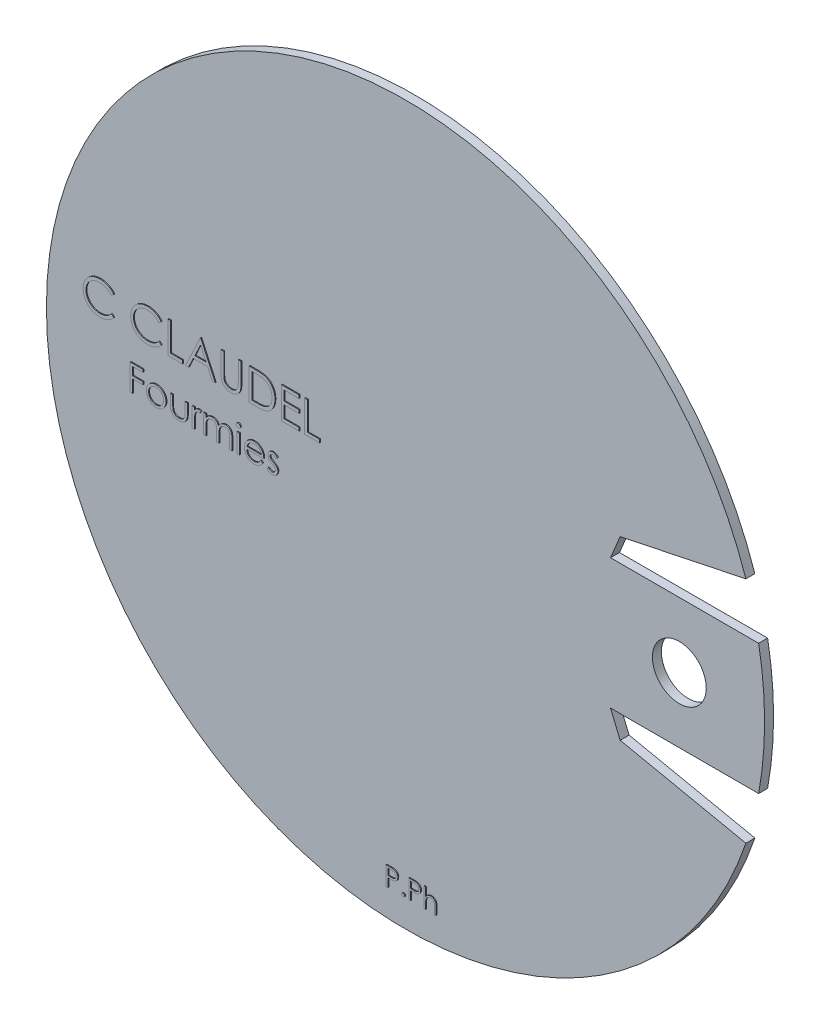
from build123d import *

# Parameters (mm, degrees)
ESQUISSE1_R             = 40
BOSS_EXTRU_1_DEPTH      = 1
ESQUISSE2_R             = 3
ENL_V_MAT_EXTRU_1_DEPTH = 57.577380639
ENL_V_MAT_EXTRU_2_DEPTH = 57.577380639
ESQUISSE4_W             = 0.261191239
ESQUISSE4_H             = 2.126842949
BOSS_EXTRU_2_DEPTH      = 0.1


with BuildPart() as part:
    # Esquisse1 → Boss.-Extru.1 (new body)
    with BuildSketch(Plane.XY):
        Circle(ESQUISSE1_R)
    extrude(amount=BOSS_EXTRU_1_DEPTH)

    # Esquisse2 → Enl_v. mat.-Extru.1 (cut, through all)
    with BuildSketch(Plane.XY.offset(1)):
        with Locations((30.5, 0)):
            Circle(ESQUISSE2_R)
    extrude(amount=-ENL_V_MAT_EXTRU_1_DEPTH, mode=Mode.SUBTRACT)

    # Esquisse3 → Enl_v. mat.-Extru.2 (cut, through all)
    with BuildSketch(Plane.XY.offset(1)):
        with BuildLine():
            Line((22.837482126, 7.25), (39.337482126, 7.25))
            ThreePointArc((39.337482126, 7.25), (38.723288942, 10.025312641), (37.913552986, 12.75))
            Line((37.913552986, 12.75), (23.90849107, 9.824127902))
            Line((23.90849107, 9.824127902), (22.837482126, 7.25))
        make_face()
        with BuildLine():
            Line((22.837482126, -7.25), (39.337482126, -7.25))
            ThreePointArc((39.337482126, -7.25), (38.723288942, -10.025312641), (37.913552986, -12.75))
            Line((37.913552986, -12.75), (23.90849107, -9.824127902))
            Line((23.90849107, -9.824127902), (22.837482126, -7.25))
        make_face()
    extrude(amount=-ENL_V_MAT_EXTRU_2_DEPTH, mode=Mode.SUBTRACT)

    # Esquisse4 → Boss.-Extru.2 (add)
    # profile 1 of 21: a face of its own
    with BuildSketch(Plane.XY.offset(1)):
        with BuildLine():
            Line((-32.394961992, 5.074638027), (-32.669801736, 4.864301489))
            add(Edge.make_bspline(
                [(-32.669801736, 4.864301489), (-32.689407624, 4.887667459), (-32.728355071, 4.934084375), (-32.791014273, 4.999263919), (-32.856315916, 5.06032918), (-32.924235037, 5.11757106), (-32.995994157, 5.168987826), (-33.069854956, 5.217258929), (-33.147053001, 5.260526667), (-33.253804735, 5.312989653), (-33.393452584, 5.367735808), (-33.569247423, 5.413639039), (-33.752758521, 5.442860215), (-33.877956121, 5.446025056), (-33.941636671, 5.447634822)],
                knots=[0, 0, 0, 0, 0.757959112, 1.505699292, 2.245454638, 2.979532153, 3.711538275, 4.438200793, 5.171680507, 5.909471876, 7.393775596, 8.890124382, 10.418191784, 12, 12, 12, 12], degree=3))
            add(Edge.make_bspline(
                [(-33.941636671, 5.447634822), (-33.976719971, 5.44723086), (-34.046560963, 5.446426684), (-34.150209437, 5.435817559), (-34.251922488, 5.420906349), (-34.351633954, 5.398781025), (-34.449216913, 5.370808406), (-34.545309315, 5.337382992), (-34.638519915, 5.296028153), (-34.730138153, 5.250319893), (-34.817917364, 5.198692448), (-34.900972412, 5.142379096), (-34.97900038, 5.08201), (-35.052062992, 5.017358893), (-35.12023494, 4.948716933), (-35.183022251, 4.875352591), (-35.240207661, 4.797500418), (-35.292924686, 4.71618701), (-35.34013742, 4.631649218), (-35.379667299, 4.543574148), (-35.414672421, 4.453470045), (-35.442371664, 4.360318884), (-35.464296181, 4.264776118), (-35.479423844, 4.16658533), (-35.489912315, 4.065951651), (-35.490712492, 3.997742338), (-35.491115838, 3.963359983)],
                knots=[0, 0, 0, 0, 1.054917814, 2.100044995, 3.131103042, 4.146048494, 5.169673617, 6.183595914, 7.203665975, 8.234915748, 9.262203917, 10.264457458, 11.251630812, 12.227803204, 13.197192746, 14.159520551, 15.12972552, 16.100847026, 17.073214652, 18.039054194, 19.002613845, 19.979014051, 20.95965708, 21.949030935, 22.966165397, 24, 24, 24, 24], degree=3))
            add(Edge.make_bspline(
                [(-35.491115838, 3.963359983), (-35.489854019, 3.911628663), (-35.487376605, 3.810061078), (-35.465328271, 3.661290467), (-35.431823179, 3.518769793), (-35.381607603, 3.383389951), (-35.319688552, 3.253481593), (-35.24144794, 3.13124274), (-35.150831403, 3.014826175), (-35.046556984, 2.906983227), (-34.932151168, 2.808469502), (-34.809403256, 2.721718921), (-34.678618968, 2.649404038), (-34.541242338, 2.589228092), (-34.396216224, 2.542971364), (-34.243801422, 2.51040724), (-34.084329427, 2.48916506), (-33.975360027, 2.487131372), (-33.919901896, 2.486096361)],
                knots=[0, 0, 0, 0, 1.029171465, 2.020641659, 2.987623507, 3.938342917, 4.889210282, 5.84687017, 6.821220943, 7.821438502, 8.827599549, 9.822697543, 10.807740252, 11.797342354, 12.80366471, 13.83203677, 14.896651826, 16, 16, 16, 16], degree=3))
            add(Edge.make_bspline(
                [(-33.919901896, 2.486096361), (-33.858799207, 2.487785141), (-33.738534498, 2.491109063), (-33.562166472, 2.519268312), (-33.393330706, 2.56492623), (-33.232018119, 2.628824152), (-33.078683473, 2.71188944), (-32.933086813, 2.812587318), (-32.795105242, 2.93187565), (-32.71213396, 3.022958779), (-32.669801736, 3.069429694)],
                knots=[0, 0, 0, 0, 1.028121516, 2.023589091, 2.998037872, 3.967518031, 4.937445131, 5.927275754, 6.942489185, 8, 8, 8, 8], degree=3))
            Line((-32.669801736, 3.069429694), (-32.394961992, 2.861196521))
            add(Edge.make_bspline(
                [(-32.394961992, 2.861196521), (-32.417080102, 2.832658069), (-32.461210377, 2.775717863), (-32.532668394, 2.695446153), (-32.607945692, 2.619942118), (-32.687601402, 2.549814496), (-32.770719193, 2.483660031), (-32.858791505, 2.4233582), (-32.950660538, 2.368067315), (-33.046015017, 2.317440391), (-33.14475363, 2.272523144), (-33.246758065, 2.234069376), (-33.35158864, 2.200944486), (-33.459250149, 2.17369255), (-33.569965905, 2.152421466), (-33.683336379, 2.138201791), (-33.799606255, 2.128459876), (-33.878047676, 2.127571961), (-33.91779853, 2.127122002)],
                knots=[0, 0, 0, 0, 0.986787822, 1.968848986, 2.935600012, 3.899624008, 4.868462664, 5.837806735, 6.815139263, 7.798259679, 8.787526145, 9.778297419, 10.776456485, 11.791383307, 12.812564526, 13.85620153, 14.913611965, 16, 16, 16, 16], degree=3))
            add(Edge.make_bspline(
                [(-33.91779853, 2.127122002), (-33.955442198, 2.127383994), (-34.029877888, 2.127902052), (-34.139776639, 2.13629422), (-34.24676622, 2.147743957), (-34.350540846, 2.164984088), (-34.451666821, 2.185328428), (-34.549227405, 2.212599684), (-34.644182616, 2.243148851), (-34.736150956, 2.279053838), (-34.825210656, 2.31957002), (-34.911074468, 2.365361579), (-34.9937029, 2.416043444), (-35.073908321, 2.470498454), (-35.150505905, 2.530475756), (-35.22415943, 2.59514239), (-35.295281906, 2.664280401), (-35.339284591, 2.714135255), (-35.361408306, 2.739201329)],
                knots=[0, 0, 0, 0, 1.114604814, 2.203992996, 3.262667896, 4.300477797, 5.318619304, 6.316056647, 7.298880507, 8.271930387, 9.238335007, 10.195173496, 11.151986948, 12.108099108, 13.064862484, 14.031167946, 15.010108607, 16, 16, 16, 16], degree=3))
            add(Edge.make_bspline(
                [(-35.361408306, 2.739201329), (-35.39684395, 2.782742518), (-35.467287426, 2.869299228), (-35.55741311, 3.009585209), (-35.634560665, 3.156053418), (-35.696936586, 3.309473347), (-35.745699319, 3.469500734), (-35.779480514, 3.636216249), (-35.801432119, 3.809464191), (-35.803942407, 3.927300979), (-35.805218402, 3.987198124)],
                knots=[0, 0, 0, 0, 0.994628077, 1.977248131, 2.950237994, 3.925870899, 4.908910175, 5.911660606, 6.938484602, 8, 8, 8, 8], degree=3))
            add(Edge.make_bspline(
                [(-35.805218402, 3.987198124), (-35.803663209, 4.050153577), (-35.800603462, 4.174014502), (-35.774607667, 4.355788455), (-35.732788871, 4.529939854), (-35.673391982, 4.696143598), (-35.598086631, 4.855273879), (-35.505060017, 5.006115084), (-35.395392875, 5.149631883), (-35.269945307, 5.283646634), (-35.132377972, 5.406185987), (-34.985059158, 5.513992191), (-34.828277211, 5.603709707), (-34.663759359, 5.678705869), (-34.490273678, 5.736350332), (-34.308190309, 5.776703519), (-34.117851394, 5.801820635), (-33.987988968, 5.804995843), (-33.922005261, 5.806609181)],
                knots=[0, 0, 0, 0, 1.032925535, 2.032216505, 3.007276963, 3.968222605, 4.92396291, 5.891752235, 6.871517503, 7.883894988, 8.900124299, 9.891468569, 10.874487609, 11.85992873, 12.854644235, 13.869047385, 14.917252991, 16, 16, 16, 16], degree=3))
            add(Edge.make_bspline(
                [(-33.922005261, 5.806609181), (-33.881790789, 5.806127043), (-33.802190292, 5.805172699), (-33.68443764, 5.795866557), (-33.569795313, 5.780352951), (-33.458184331, 5.759236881), (-33.349061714, 5.733029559), (-33.243261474, 5.698889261), (-33.140162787, 5.65985273), (-33.040415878, 5.614894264), (-32.944499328, 5.564427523), (-32.85244301, 5.509011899), (-32.764978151, 5.448716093), (-32.681489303, 5.384052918), (-32.603373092, 5.313654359), (-32.528411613, 5.239456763), (-32.459150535, 5.159322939), (-32.41639734, 5.102918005), (-32.394961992, 5.074638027)],
                knots=[0, 0, 0, 0, 1.096760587, 2.17092713, 3.219439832, 4.250915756, 5.268269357, 6.278326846, 7.281116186, 8.274029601, 9.260640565, 10.235837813, 11.203064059, 12.156899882, 13.114053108, 14.069676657, 15.032185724, 16, 16, 16, 16], degree=3))
        make_face()
    # profile 2 of 21: a face of its own
    with BuildSketch(Plane.XY.offset(1)):
        with BuildLine():
            Line((-27.100090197, 5.074638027), (-27.374929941, 4.864301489))
            add(Edge.make_bspline(
                [(-27.374929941, 4.864301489), (-27.394535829, 4.887667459), (-27.433483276, 4.934084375), (-27.496142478, 4.999263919), (-27.561444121, 5.06032918), (-27.629363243, 5.11757106), (-27.701122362, 5.168987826), (-27.774983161, 5.217258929), (-27.852181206, 5.260526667), (-27.958932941, 5.312989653), (-28.098580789, 5.367735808), (-28.274375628, 5.413639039), (-28.457886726, 5.442860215), (-28.583084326, 5.446025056), (-28.646764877, 5.447634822)],
                knots=[0, 0, 0, 0, 0.757959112, 1.505699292, 2.245454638, 2.979532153, 3.711538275, 4.438200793, 5.171680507, 5.909471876, 7.393775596, 8.890124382, 10.418191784, 12, 12, 12, 12], degree=3))
            add(Edge.make_bspline(
                [(-28.646764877, 5.447634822), (-28.681848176, 5.44723086), (-28.751689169, 5.446426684), (-28.855337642, 5.435817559), (-28.957050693, 5.420906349), (-29.056762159, 5.398781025), (-29.154345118, 5.370808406), (-29.25043752, 5.337382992), (-29.34364812, 5.296028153), (-29.435266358, 5.250319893), (-29.523045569, 5.198692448), (-29.606100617, 5.142379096), (-29.684128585, 5.08201), (-29.757191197, 5.017358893), (-29.825363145, 4.948716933), (-29.888150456, 4.875352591), (-29.945335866, 4.797500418), (-29.998052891, 4.71618701), (-30.045265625, 4.631649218), (-30.084795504, 4.543574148), (-30.119800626, 4.453470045), (-30.147499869, 4.360318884), (-30.169424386, 4.264776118), (-30.184552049, 4.16658533), (-30.19504052, 4.065951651), (-30.195840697, 3.997742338), (-30.196244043, 3.963359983)],
                knots=[0, 0, 0, 0, 1.054917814, 2.100044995, 3.131103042, 4.146048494, 5.169673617, 6.183595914, 7.203665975, 8.234915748, 9.262203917, 10.264457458, 11.251630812, 12.227803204, 13.197192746, 14.159520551, 15.12972552, 16.100847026, 17.073214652, 18.039054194, 19.002613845, 19.979014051, 20.95965708, 21.949030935, 22.966165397, 24, 24, 24, 24], degree=3))
            add(Edge.make_bspline(
                [(-30.196244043, 3.963359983), (-30.194982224, 3.911628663), (-30.19250481, 3.810061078), (-30.170456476, 3.661290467), (-30.136951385, 3.518769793), (-30.086735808, 3.383389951), (-30.024816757, 3.253481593), (-29.946576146, 3.13124274), (-29.855959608, 3.014826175), (-29.751685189, 2.906983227), (-29.637279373, 2.808469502), (-29.514531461, 2.721718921), (-29.383747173, 2.649404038), (-29.246370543, 2.589228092), (-29.101344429, 2.542971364), (-28.948929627, 2.51040724), (-28.789457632, 2.48916506), (-28.680488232, 2.487131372), (-28.625030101, 2.486096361)],
                knots=[0, 0, 0, 0, 1.029171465, 2.020641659, 2.987623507, 3.938342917, 4.889210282, 5.84687017, 6.821220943, 7.821438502, 8.827599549, 9.822697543, 10.807740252, 11.797342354, 12.80366471, 13.83203677, 14.896651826, 16, 16, 16, 16], degree=3))
            add(Edge.make_bspline(
                [(-28.625030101, 2.486096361), (-28.563927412, 2.487785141), (-28.443662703, 2.491109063), (-28.267294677, 2.519268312), (-28.098458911, 2.56492623), (-27.937146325, 2.628824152), (-27.783811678, 2.71188944), (-27.638215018, 2.812587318), (-27.500233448, 2.93187565), (-27.417262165, 3.022958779), (-27.374929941, 3.069429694)],
                knots=[0, 0, 0, 0, 1.028121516, 2.023589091, 2.998037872, 3.967518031, 4.937445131, 5.927275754, 6.942489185, 8, 8, 8, 8], degree=3))
            Line((-27.374929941, 3.069429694), (-27.100090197, 2.861196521))
            add(Edge.make_bspline(
                [(-27.100090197, 2.861196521), (-27.122208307, 2.832658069), (-27.166338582, 2.775717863), (-27.237796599, 2.695446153), (-27.313073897, 2.619942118), (-27.392729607, 2.549814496), (-27.475847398, 2.483660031), (-27.563919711, 2.4233582), (-27.655788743, 2.368067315), (-27.751143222, 2.317440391), (-27.849881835, 2.272523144), (-27.95188627, 2.234069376), (-28.056716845, 2.200944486), (-28.164378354, 2.17369255), (-28.275094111, 2.152421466), (-28.388464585, 2.138201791), (-28.50473446, 2.128459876), (-28.583175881, 2.127571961), (-28.622926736, 2.127122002)],
                knots=[0, 0, 0, 0, 0.986787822, 1.968848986, 2.935600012, 3.899624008, 4.868462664, 5.837806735, 6.815139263, 7.798259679, 8.787526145, 9.778297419, 10.776456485, 11.791383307, 12.812564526, 13.85620153, 14.913611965, 16, 16, 16, 16], degree=3))
            add(Edge.make_bspline(
                [(-28.622926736, 2.127122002), (-28.660570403, 2.127383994), (-28.735006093, 2.127902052), (-28.844904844, 2.13629422), (-28.951894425, 2.147743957), (-29.055669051, 2.164984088), (-29.156795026, 2.185328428), (-29.254355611, 2.212599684), (-29.349310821, 2.243148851), (-29.441279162, 2.279053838), (-29.530338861, 2.31957002), (-29.616202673, 2.365361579), (-29.698831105, 2.416043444), (-29.779036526, 2.470498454), (-29.85563411, 2.530475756), (-29.929287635, 2.59514239), (-30.000410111, 2.664280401), (-30.044412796, 2.714135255), (-30.066536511, 2.739201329)],
                knots=[0, 0, 0, 0, 1.114604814, 2.203992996, 3.262667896, 4.300477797, 5.318619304, 6.316056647, 7.298880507, 8.271930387, 9.238335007, 10.195173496, 11.151986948, 12.108099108, 13.064862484, 14.031167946, 15.010108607, 16, 16, 16, 16], degree=3))
            add(Edge.make_bspline(
                [(-30.066536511, 2.739201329), (-30.101972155, 2.782742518), (-30.172415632, 2.869299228), (-30.262541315, 3.009585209), (-30.33968887, 3.156053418), (-30.402064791, 3.309473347), (-30.450827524, 3.469500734), (-30.484608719, 3.636216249), (-30.506560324, 3.809464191), (-30.509070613, 3.927300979), (-30.510346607, 3.987198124)],
                knots=[0, 0, 0, 0, 0.994628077, 1.977248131, 2.950237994, 3.925870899, 4.908910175, 5.911660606, 6.938484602, 8, 8, 8, 8], degree=3))
            add(Edge.make_bspline(
                [(-30.510346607, 3.987198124), (-30.508791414, 4.050153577), (-30.505731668, 4.174014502), (-30.479735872, 4.355788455), (-30.437917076, 4.529939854), (-30.378520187, 4.696143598), (-30.303214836, 4.855273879), (-30.210188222, 5.006115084), (-30.10052108, 5.149631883), (-29.975073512, 5.283646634), (-29.837506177, 5.406185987), (-29.690187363, 5.513992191), (-29.533405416, 5.603709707), (-29.368887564, 5.678705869), (-29.195401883, 5.736350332), (-29.013318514, 5.776703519), (-28.822979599, 5.801820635), (-28.693117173, 5.804995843), (-28.627133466, 5.806609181)],
                knots=[0, 0, 0, 0, 1.032925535, 2.032216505, 3.007276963, 3.968222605, 4.92396291, 5.891752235, 6.871517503, 7.883894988, 8.900124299, 9.891468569, 10.874487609, 11.85992873, 12.854644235, 13.869047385, 14.917252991, 16, 16, 16, 16], degree=3))
            add(Edge.make_bspline(
                [(-28.627133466, 5.806609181), (-28.586918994, 5.806127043), (-28.507318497, 5.805172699), (-28.389565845, 5.795866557), (-28.274923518, 5.780352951), (-28.163312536, 5.759236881), (-28.05418992, 5.733029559), (-27.948389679, 5.698889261), (-27.845290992, 5.65985273), (-27.745544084, 5.614894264), (-27.649627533, 5.564427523), (-27.557571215, 5.509011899), (-27.470106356, 5.448716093), (-27.386617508, 5.384052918), (-27.308501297, 5.313654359), (-27.233539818, 5.239456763), (-27.16427874, 5.159322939), (-27.121525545, 5.102918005), (-27.100090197, 5.074638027)],
                knots=[0, 0, 0, 0, 1.096760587, 2.17092713, 3.219439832, 4.250915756, 5.268269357, 6.278326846, 7.281116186, 8.274029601, 9.260640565, 10.235837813, 11.203064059, 12.156899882, 13.114053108, 14.069676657, 15.032185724, 16, 16, 16, 16], degree=3))
        make_face()
    # profile 3 of 21: a face of its own
    with BuildSketch(Plane.XY.offset(1)):
        Polygon((-26.382141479, 5.716865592), (-26.068038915, 5.716865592), (-26.068038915, 2.575839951), (-24.721885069, 2.575839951), (-24.721885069, 2.216865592), (-26.382141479, 2.216865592), align=None)
    # profile 4 of 21: a face of its own
    with BuildSketch(Plane.XY.offset(1)):
        Polygon((-22.7026543, 5.716865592), (-21.087269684, 2.216865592), (-21.428715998, 2.216865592), (-21.946143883, 3.338660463), (-23.532782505, 3.338660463), (-24.064933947, 2.216865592), (-24.407782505, 2.216865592), (-22.747526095, 5.716865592), align=None)
        Polygon((-22.728595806, 5.034674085), (-23.362409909, 3.697634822), (-22.111608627, 3.697634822), align=None, mode=Mode.SUBTRACT)
    # profile 5 of 21: a face of its own
    with BuildSketch(Plane.XY.offset(1)):
        with BuildLine():
            Line((-20.459064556, 5.716865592), (-20.144961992, 5.716865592))
            Line((-20.144961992, 5.716865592), (-20.144961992, 3.619810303))
            add(Edge.make_bspline(
                [(-20.144961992, 3.619810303), (-20.145008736, 3.590129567), (-20.145097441, 3.533805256), (-20.144504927, 3.453636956), (-20.142845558, 3.382364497), (-20.141799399, 3.319713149), (-20.139472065, 3.265970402), (-20.137574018, 3.220845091), (-20.135133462, 3.184550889), (-20.132200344, 3.163369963), (-20.130939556, 3.154265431)],
                knots=[0, 0, 0, 0, 1.528628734, 2.90083645, 4.128790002, 5.200304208, 6.127813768, 6.898992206, 7.526736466, 8, 8, 8, 8], degree=3))
            add(Edge.make_bspline(
                [(-20.130939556, 3.154265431), (-20.125762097, 3.121418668), (-20.115698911, 3.057575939), (-20.090052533, 2.966667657), (-20.054235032, 2.884736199), (-20.011791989, 2.809224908), (-19.955859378, 2.742235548), (-19.888855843, 2.680523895), (-19.807678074, 2.62655209), (-19.717417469, 2.577201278), (-19.620132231, 2.537536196), (-19.520720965, 2.507542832), (-19.420677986, 2.489263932), (-19.353701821, 2.487147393), (-19.320442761, 2.486096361)],
                knots=[0, 0, 0, 0, 1.035780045, 2.013197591, 2.933192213, 3.817615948, 4.702609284, 5.640816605, 6.646850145, 7.73207398, 8.84249596, 9.914020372, 10.964143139, 12, 12, 12, 12], degree=3))
            add(Edge.make_bspline(
                [(-19.320442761, 2.486096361), (-19.291889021, 2.487170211), (-19.234946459, 2.489311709), (-19.150340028, 2.50257314), (-19.06793992, 2.526473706), (-18.98733924, 2.557313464), (-18.911788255, 2.598061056), (-18.841244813, 2.645131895), (-18.778280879, 2.700342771), (-18.720822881, 2.761443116), (-18.670787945, 2.830382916), (-18.627416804, 2.905661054), (-18.591890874, 2.9884104), (-18.574347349, 3.046564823), (-18.565334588, 3.076440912)],
                knots=[0, 0, 0, 0, 0.994687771, 1.983630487, 2.973142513, 3.978332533, 4.983357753, 5.956394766, 6.925816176, 7.893390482, 8.871859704, 9.88551698, 10.913711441, 12, 12, 12, 12], degree=3))
            add(Edge.make_bspline(
                [(-18.565334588, 3.076440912), (-18.562334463, 3.088789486), (-18.555648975, 3.116307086), (-18.54940193, 3.162828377), (-18.542895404, 3.217717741), (-18.538380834, 3.281369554), (-18.533979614, 3.353570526), (-18.531346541, 3.434696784), (-18.530129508, 3.524453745), (-18.529766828, 3.587090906), (-18.529577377, 3.619810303)],
                knots=[0, 0, 0, 0, 0.558680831, 1.244966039, 2.062412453, 2.990489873, 4.051219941, 5.244515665, 6.560634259, 8, 8, 8, 8], degree=3))
            Line((-18.529577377, 3.619810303), (-18.529577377, 5.716865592))
            Line((-18.529577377, 5.716865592), (-18.215474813, 5.716865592))
            Line((-18.215474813, 5.716865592), (-18.215474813, 3.60298338))
            add(Edge.make_bspline(
                [(-18.215474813, 3.60298338), (-18.215728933, 3.564885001), (-18.216224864, 3.490533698), (-18.220525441, 3.381582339), (-18.227382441, 3.278229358), (-18.237070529, 3.180460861), (-18.249907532, 3.088626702), (-18.264182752, 3.001921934), (-18.282362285, 2.920968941), (-18.303595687, 2.845136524), (-18.327869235, 2.77295101), (-18.359310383, 2.704442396), (-18.394734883, 2.637527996), (-18.436749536, 2.573219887), (-18.483960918, 2.511233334), (-18.537412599, 2.451944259), (-18.59533676, 2.394405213), (-18.65869632, 2.340092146), (-18.726446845, 2.29028347), (-18.798386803, 2.246485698), (-18.873963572, 2.209462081), (-18.952980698, 2.178986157), (-19.035471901, 2.156071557), (-19.121439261, 2.138996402), (-19.211078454, 2.129294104), (-19.272043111, 2.127852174), (-19.302914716, 2.127122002)],
                knots=[0, 0, 0, 0, 1.316592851, 2.569410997, 3.76748051, 4.895814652, 5.963796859, 6.97159953, 7.931736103, 8.829262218, 9.692595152, 10.560224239, 11.431080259, 12.30701507, 13.211635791, 14.121146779, 15.063487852, 16.031507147, 17.00238618, 17.966455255, 18.938106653, 19.907068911, 20.888905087, 21.893141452, 22.933117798, 24, 24, 24, 24], degree=3))
            add(Edge.make_bspline(
                [(-19.302914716, 2.127122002), (-19.336583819, 2.127906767), (-19.402642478, 2.129446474), (-19.499980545, 2.138269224), (-19.593294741, 2.154887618), (-19.683570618, 2.176047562), (-19.769579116, 2.205231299), (-19.85247256, 2.239329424), (-19.930831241, 2.281206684), (-20.00592637, 2.327800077), (-20.075751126, 2.380224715), (-20.139848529, 2.437364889), (-20.1983244, 2.498305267), (-20.250193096, 2.563705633), (-20.29631398, 2.63305734), (-20.336044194, 2.706556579), (-20.370157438, 2.784174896), (-20.387764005, 2.838128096), (-20.396664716, 2.865403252)],
                knots=[0, 0, 0, 0, 1.13879206, 2.234305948, 3.301075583, 4.341971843, 5.366689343, 6.369221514, 7.369726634, 8.367512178, 9.355451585, 10.318319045, 11.268648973, 12.207971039, 13.137398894, 14.081662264, 15.030215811, 16, 16, 16, 16], degree=3))
            add(Edge.make_bspline(
                [(-20.396664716, 2.865403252), (-20.401841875, 2.884035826), (-20.413071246, 2.924450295), (-20.425096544, 2.991336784), (-20.435205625, 3.068351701), (-20.444711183, 3.15550032), (-20.450320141, 3.252850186), (-20.45523758, 3.360359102), (-20.459099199, 3.478157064), (-20.459076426, 3.56021158), (-20.459064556, 3.60298338)],
                knots=[0, 0, 0, 0, 0.625038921, 1.35572334, 2.194682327, 3.136881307, 4.189498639, 5.346923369, 6.617055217, 8, 8, 8, 8], degree=3))
            Line((-20.459064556, 3.60298338), (-20.459064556, 5.716865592))
        make_face()
    # profile 6 of 21: a face of its own
    with BuildSketch(Plane.XY.offset(1)):
        with BuildLine():
            Line((-17.318038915, 2.216865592), (-17.318038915, 5.716865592))
            Line((-17.318038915, 5.716865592), (-16.611308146, 5.716865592))
            add(Edge.make_bspline(
                [(-16.611308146, 5.716865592), (-16.549839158, 5.716423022), (-16.431081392, 5.715567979), (-16.259468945, 5.710146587), (-16.100685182, 5.700556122), (-15.955252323, 5.686586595), (-15.822771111, 5.669433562), (-15.703612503, 5.647933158), (-15.59716036, 5.622544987), (-15.53169092, 5.600899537), (-15.500731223, 5.590663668)],
                knots=[0, 0, 0, 0, 1.314313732, 2.53924729, 3.670748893, 4.714932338, 5.66265055, 6.526160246, 7.303039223, 8, 8, 8, 8], degree=3))
            add(Edge.make_bspline(
                [(-15.500731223, 5.590663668), (-15.460236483, 5.575232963), (-15.380165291, 5.544721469), (-15.266158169, 5.487165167), (-15.158832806, 5.421952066), (-15.057613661, 5.348996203), (-14.964812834, 5.266231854), (-14.876804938, 5.177174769), (-14.797190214, 5.078586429), (-14.724281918, 4.972511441), (-14.658546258, 4.860199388), (-14.6014071, 4.74186428), (-14.553953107, 4.618107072), (-14.514559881, 4.489271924), (-14.483513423, 4.355075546), (-14.462331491, 4.21536168), (-14.448360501, 4.07068249), (-14.44695645, 3.972508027), (-14.446244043, 3.922694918)],
                knots=[0, 0, 0, 0, 0.984719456, 1.947108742, 2.898477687, 3.838006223, 4.779231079, 5.722358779, 6.681677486, 7.655904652, 8.64651281, 9.637519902, 10.640069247, 11.656948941, 12.698408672, 13.768548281, 14.867775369, 16, 16, 16, 16], degree=3))
            add(Edge.make_bspline(
                [(-14.446244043, 3.922694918), (-14.446873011, 3.87943368), (-14.448112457, 3.794182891), (-14.459241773, 3.668541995), (-14.475418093, 3.546628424), (-14.500462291, 3.429022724), (-14.530864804, 3.314694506), (-14.569828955, 3.204862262), (-14.614464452, 3.098518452), (-14.66651433, 2.997100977), (-14.723655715, 2.901017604), (-14.784977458, 2.810442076), (-14.850414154, 2.726666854), (-14.920589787, 2.649438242), (-14.994597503, 2.578872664), (-15.072921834, 2.514380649), (-15.155764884, 2.457224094), (-15.242755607, 2.405156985), (-15.336431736, 2.35973663), (-15.438567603, 2.32130662), (-15.549598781, 2.289460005), (-15.669252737, 2.262889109), (-15.797736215, 2.241811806), (-15.935175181, 2.227685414), (-16.081358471, 2.218132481), (-16.181737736, 2.217296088), (-16.233403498, 2.216865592)],
                knots=[0, 0, 0, 0, 1.105936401, 2.179363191, 3.223086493, 4.248585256, 5.251745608, 6.245858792, 7.225916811, 8.198733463, 9.158002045, 10.082870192, 10.993790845, 11.873723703, 12.748670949, 13.606408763, 14.465103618, 15.319838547, 16.196477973, 17.123216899, 18.106603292, 19.147568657, 20.255746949, 21.433717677, 22.679120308, 24, 24, 24, 24], degree=3))
            Line((-16.233403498, 2.216865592), (-17.318038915, 2.216865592))
        make_face()
        with BuildLine():
            Line((-17.003936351, 2.575839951), (-16.602193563, 2.575839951))
            add(Edge.make_bspline(
                [(-16.602193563, 2.575839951), (-16.544465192, 2.576088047), (-16.433432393, 2.576565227), (-16.273774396, 2.58075243), (-16.127895, 2.587594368), (-15.99577349, 2.597169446), (-15.877484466, 2.609838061), (-15.772780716, 2.623962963), (-15.682005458, 2.641560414), (-15.627076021, 2.657511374), (-15.601692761, 2.664882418)],
                knots=[0, 0, 0, 0, 1.375205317, 2.645023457, 3.804390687, 4.853969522, 5.800190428, 6.637939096, 7.370582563, 8, 8, 8, 8], degree=3))
            add(Edge.make_bspline(
                [(-15.601692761, 2.664882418), (-15.569744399, 2.676133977), (-15.506610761, 2.69836835), (-15.415729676, 2.738926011), (-15.330972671, 2.786968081), (-15.250862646, 2.840370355), (-15.17653599, 2.901016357), (-15.107111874, 2.967587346), (-15.042730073, 3.040422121), (-14.984055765, 3.119430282), (-14.931547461, 3.204120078), (-14.886076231, 3.293658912), (-14.8462247, 3.387065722), (-14.814946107, 3.485774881), (-14.790430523, 3.588903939), (-14.773065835, 3.696460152), (-14.76225111, 3.808423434), (-14.760989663, 3.884575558), (-14.760346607, 3.92339604)],
                knots=[0, 0, 0, 0, 0.998632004, 1.973411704, 2.929992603, 3.868527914, 4.809262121, 5.754881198, 6.702106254, 7.672490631, 8.653608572, 9.636854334, 10.631411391, 11.644891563, 12.686317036, 13.754757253, 14.855430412, 16, 16, 16, 16], degree=3))
            add(Edge.make_bspline(
                [(-14.760346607, 3.92339604), (-14.760859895, 3.964329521), (-14.761868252, 4.044743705), (-14.774542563, 4.1627344), (-14.793064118, 4.276215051), (-14.819847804, 4.385193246), (-14.853978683, 4.489881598), (-14.896573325, 4.589701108), (-14.945239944, 4.685705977), (-15.003143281, 4.775680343), (-15.066558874, 4.860773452), (-15.136936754, 4.938728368), (-15.213158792, 5.009722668), (-15.294393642, 5.074861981), (-15.382930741, 5.131525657), (-15.476684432, 5.182212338), (-15.577030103, 5.225228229), (-15.646842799, 5.248107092), (-15.682321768, 5.259734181)],
                knots=[0, 0, 0, 0, 1.122418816, 2.205001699, 3.251619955, 4.274784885, 5.280384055, 6.268708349, 7.249350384, 8.229342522, 9.199999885, 10.157847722, 11.105861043, 12.055065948, 13.010012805, 13.98527497, 14.976112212, 16, 16, 16, 16], degree=3))
            add(Edge.make_bspline(
                [(-15.682321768, 5.259734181), (-15.711672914, 5.267850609), (-15.774081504, 5.285108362), (-15.875920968, 5.303933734), (-15.990536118, 5.320538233), (-16.118435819, 5.334596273), (-16.259474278, 5.344683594), (-16.413759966, 5.352254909), (-16.581359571, 5.357361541), (-16.697542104, 5.357710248), (-16.757842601, 5.357891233)],
                knots=[0, 0, 0, 0, 0.674548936, 1.434276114, 2.292660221, 3.240891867, 4.284742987, 5.42552168, 6.663806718, 8, 8, 8, 8], degree=3))
            Line((-16.757842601, 5.357891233), (-17.003936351, 5.357891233))
            Line((-17.003936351, 5.357891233), (-17.003936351, 2.575839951))
        make_face(mode=Mode.SUBTRACT)
    # profile 7 of 21: a face of its own
    with BuildSketch(Plane.XY.offset(1)):
        Polygon((-13.728295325, 5.716865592), (-11.753936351, 5.716865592), (-11.753936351, 5.357891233), (-13.414192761, 5.357891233), (-13.414192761, 4.280968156), (-11.753936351, 4.280968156), (-11.753936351, 3.921993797), (-13.414192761, 3.921993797), (-13.414192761, 2.575839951), (-11.753936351, 2.575839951), (-11.753936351, 2.216865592), (-13.728295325, 2.216865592), align=None)
    # profile 8 of 21: a face of its own
    with BuildSketch(Plane.XY.offset(1)):
        Polygon((-11.125731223, 5.716865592), (-10.811628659, 5.716865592), (-10.811628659, 2.575839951), (-9.465474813, 2.575839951), (-9.465474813, 2.216865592), (-11.125731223, 2.216865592), align=None)
    # profile 9 of 21: a face of its own
    with BuildSketch(Plane.XY.offset(1)):
        Polygon((-30.57060793, -0.517672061), (-29.152712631, -0.517672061), (-29.152712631, -0.816176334), (-30.30941669, -0.816176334), (-30.30941669, -1.711689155), (-29.152712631, -1.711689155), (-29.152712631, -2.010193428), (-30.30941669, -2.010193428), (-30.30941669, -3.428088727), (-30.57060793, -3.428088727), align=None)
    # profile 10 of 21: a face of its own
    with BuildSketch(Plane.XY.offset(1)):
        with BuildLine():
            add(Edge.make_bspline(
                [(-27.677681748, -1.263932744), (-27.637774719, -1.264782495), (-27.559526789, -1.26644865), (-27.444932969, -1.284256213), (-27.335546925, -1.311487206), (-27.230949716, -1.349132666), (-27.132480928, -1.399592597), (-27.038706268, -1.459804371), (-26.949882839, -1.531136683), (-26.896644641, -1.586316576), (-26.869621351, -1.614325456)],
                knots=[0, 0, 0, 0, 1.054011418, 2.066658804, 3.057071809, 4.030435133, 4.997543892, 5.974964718, 6.972108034, 8, 8, 8, 8], degree=3))
            add(Edge.make_bspline(
                [(-26.869621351, -1.614325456), (-26.846353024, -1.641112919), (-26.800266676, -1.694169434), (-26.741172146, -1.780197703), (-26.690263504, -1.869289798), (-26.649465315, -1.962628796), (-26.617296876, -2.059399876), (-26.594457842, -2.159935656), (-26.580872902, -2.264014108), (-26.579041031, -2.334698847), (-26.578113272, -2.370497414)],
                knots=[0, 0, 0, 0, 1.025258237, 2.030674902, 3.01204498, 3.988269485, 4.97094183, 5.956517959, 6.965070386, 8, 8, 8, 8], degree=3))
            add(Edge.make_bspline(
                [(-26.578113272, -2.370497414), (-26.5789293, -2.406503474), (-26.580541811, -2.477653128), (-26.595795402, -2.582444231), (-26.619520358, -2.684055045), (-26.653473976, -2.782060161), (-26.697012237, -2.876759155), (-26.750140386, -2.967738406), (-26.813231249, -3.055177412), (-26.884747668, -3.138333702), (-26.963787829, -3.214974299), (-27.049533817, -3.28177108), (-27.140300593, -3.338999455), (-27.237295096, -3.385097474), (-27.339631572, -3.421444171), (-27.447530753, -3.446972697), (-27.560825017, -3.462407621), (-27.638181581, -3.464389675), (-27.677681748, -3.465401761)],
                knots=[0, 0, 0, 0, 0.998656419, 1.973391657, 2.932242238, 3.890759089, 4.846373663, 5.82037756, 6.809684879, 7.83454468, 8.860553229, 9.859544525, 10.845671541, 11.83227036, 12.833544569, 13.85385346, 14.904124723, 16, 16, 16, 16], degree=3))
            add(Edge.make_bspline(
                [(-27.677681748, -3.465401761), (-27.71737544, -3.464386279), (-27.795117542, -3.462397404), (-27.908811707, -3.447032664), (-28.016904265, -3.421455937), (-28.119374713, -3.384978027), (-28.216786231, -3.338997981), (-28.308078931, -3.281944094), (-28.393894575, -3.214954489), (-28.472951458, -3.13833907), (-28.544463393, -3.055176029), (-28.607555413, -2.967738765), (-28.660683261, -2.876759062), (-28.704221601, -2.782060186), (-28.738175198, -2.684055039), (-28.76190016, -2.582444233), (-28.777153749, -2.477653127), (-28.77876626, -2.406503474), (-28.779582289, -2.370497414)],
                knots=[0, 0, 0, 0, 1.099876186, 2.154163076, 3.173186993, 4.173200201, 5.163417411, 6.152872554, 7.150605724, 8.17532212, 9.198891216, 10.186952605, 11.159729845, 12.11414092, 13.071450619, 14.029093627, 15.002601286, 16, 16, 16, 16], degree=3))
            add(Edge.make_bspline(
                [(-28.779582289, -2.370497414), (-28.778648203, -2.334893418), (-28.776798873, -2.264403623), (-28.763227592, -2.160520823), (-28.74047765, -2.060155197), (-28.708270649, -1.963757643), (-28.66709641, -1.870827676), (-28.616903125, -1.781515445), (-28.557205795, -1.695876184), (-28.511302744, -1.642888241), (-28.488074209, -1.616074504)],
                knots=[0, 0, 0, 0, 1.031353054, 2.041901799, 3.029428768, 4.008703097, 4.981709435, 5.96992636, 6.972712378, 8, 8, 8, 8], degree=3))
            add(Edge.make_bspline(
                [(-28.488074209, -1.616074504), (-28.461091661, -1.587822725), (-28.408025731, -1.532260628), (-28.318760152, -1.461136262), (-28.225216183, -1.399671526), (-28.125659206, -1.350214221), (-28.021147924, -1.311265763), (-27.911201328, -1.284185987), (-27.796218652, -1.26651281), (-27.717587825, -1.264801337), (-27.677681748, -1.263932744)],
                knots=[0, 0, 0, 0, 1.027980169, 2.021703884, 2.998553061, 3.971491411, 4.943284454, 5.930300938, 6.949603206, 8, 8, 8, 8], degree=3))
        make_face()
        with BuildLine():
            add(Edge.make_bspline(
                [(-27.67884778, -1.525123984), (-27.70706852, -1.525926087), (-27.762781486, -1.527509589), (-27.844788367, -1.539553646), (-27.923735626, -1.558635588), (-27.999773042, -1.585747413), (-28.072644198, -1.620754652), (-28.142418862, -1.663752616), (-28.209302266, -1.714171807), (-28.271986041, -1.771933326), (-28.329514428, -1.835030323), (-28.379804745, -1.902259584), (-28.42256717, -1.972530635), (-28.458190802, -2.045916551), (-28.484723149, -2.123161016), (-28.50399262, -2.203389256), (-28.516025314, -2.286764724), (-28.517593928, -2.343443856), (-28.518391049, -2.372246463)],
                knots=[0, 0, 0, 0, 1.021534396, 2.016698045, 2.994645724, 3.958388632, 4.93408049, 5.916473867, 6.921342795, 7.962252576, 8.998418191, 10.008913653, 10.997312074, 11.973003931, 12.956656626, 13.948281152, 14.957379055, 16, 16, 16, 16], degree=3))
            add(Edge.make_bspline(
                [(-28.518391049, -2.372246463), (-28.517054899, -2.409459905), (-28.51440289, -2.483321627), (-28.492836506, -2.592097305), (-28.456758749, -2.696524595), (-28.408040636, -2.795991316), (-28.346999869, -2.888020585), (-28.275081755, -2.970070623), (-28.193058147, -3.040906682), (-28.101906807, -3.099681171), (-28.003489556, -3.146380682), (-27.89933296, -3.179475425), (-27.790699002, -3.20098897), (-27.716457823, -3.203127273), (-27.67884778, -3.204210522)],
                knots=[0, 0, 0, 0, 1.016792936, 2.018143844, 3.017858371, 4.030088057, 5.03801393, 6.028138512, 7.003788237, 7.991172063, 8.984598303, 9.972568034, 10.972917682, 12, 12, 12, 12], degree=3))
            add(Edge.make_bspline(
                [(-27.67884778, -3.204210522), (-27.641239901, -3.203120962), (-27.567002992, -3.2009702), (-27.458519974, -3.179583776), (-27.354648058, -3.146235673), (-27.256333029, -3.099733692), (-27.165223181, -3.040683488), (-27.082609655, -2.970470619), (-27.011305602, -2.887803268), (-26.950325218, -2.795869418), (-26.900809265, -2.696678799), (-26.864900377, -2.592078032), (-26.843282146, -2.483326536), (-26.840637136, -2.409461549), (-26.839304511, -2.372246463)],
                knots=[0, 0, 0, 0, 1.02726834, 2.027799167, 3.010890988, 4.004497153, 4.992059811, 5.971914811, 6.958719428, 7.966827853, 8.981595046, 9.981490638, 10.983022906, 12, 12, 12, 12], degree=3))
            add(Edge.make_bspline(
                [(-26.839304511, -2.372246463), (-26.840101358, -2.343443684), (-26.841669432, -2.286764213), (-26.853706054, -2.203391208), (-26.872960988, -2.123153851), (-26.89954691, -2.045942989), (-26.935015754, -1.972340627), (-26.978602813, -1.902465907), (-27.028687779, -1.834797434), (-27.086910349, -1.772137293), (-27.149528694, -1.71414929), (-27.216439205, -1.663733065), (-27.286110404, -1.620943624), (-27.358769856, -1.585447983), (-27.434817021, -1.558882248), (-27.513653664, -1.539443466), (-27.59531065, -1.527560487), (-27.650823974, -1.525941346), (-27.67884778, -1.525123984)],
                knots=[0, 0, 0, 0, 1.042956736, 2.052379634, 3.044323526, 4.02829302, 5.004299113, 5.996692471, 7.007513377, 8.048758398, 9.090003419, 10.095195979, 11.07790575, 12.047570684, 13.018257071, 13.989683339, 14.985167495, 16, 16, 16, 16], degree=3))
        make_face(mode=Mode.SUBTRACT)
    # profile 11 of 21: a face of its own
    with BuildSketch(Plane.XY.offset(1)):
        with BuildLine():
            Line((-26.093043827, -1.301245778), (-25.831852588, -1.301245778))
            Line((-25.831852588, -1.301245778), (-25.831852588, -2.28770912))
            add(Edge.make_bspline(
                [(-25.831852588, -2.28770912), (-25.831734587, -2.316665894), (-25.831508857, -2.372058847), (-25.829978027, -2.451766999), (-25.826377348, -2.524458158), (-25.821875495, -2.590174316), (-25.816086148, -2.648904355), (-25.809198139, -2.700443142), (-25.801499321, -2.745375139), (-25.793963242, -2.772436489), (-25.790458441, -2.785021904)],
                knots=[0, 0, 0, 0, 1.388932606, 2.656963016, 3.823490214, 4.879454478, 5.816252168, 6.653371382, 7.373723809, 8, 8, 8, 8], degree=3))
            add(Edge.make_bspline(
                [(-25.790458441, -2.785021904), (-25.784835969, -2.800840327), (-25.773707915, -2.832148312), (-25.753523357, -2.877375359), (-25.728553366, -2.919264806), (-25.701228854, -2.959431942), (-25.669713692, -2.996686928), (-25.63440662, -3.030966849), (-25.596489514, -3.063566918), (-25.540147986, -3.102138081), (-25.463097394, -3.143478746), (-25.361937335, -3.179148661), (-25.25225269, -3.200466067), (-25.176444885, -3.202939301), (-25.137480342, -3.204210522)],
                knots=[0, 0, 0, 0, 0.725840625, 1.436591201, 2.137033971, 2.831655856, 3.53531722, 4.242432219, 4.957935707, 5.694543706, 7.190802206, 8.724350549, 10.316345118, 12, 12, 12, 12], degree=3))
            add(Edge.make_bspline(
                [(-25.137480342, -3.204210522), (-25.09851942, -3.202912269), (-25.023137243, -3.200400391), (-24.914657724, -3.179791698), (-24.815494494, -3.145360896), (-24.72664284, -3.097291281), (-24.648505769, -3.038465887), (-24.583391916, -2.96944011), (-24.529667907, -2.892397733), (-24.506210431, -2.834917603), (-24.494413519, -2.806010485)],
                knots=[0, 0, 0, 0, 1.157059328, 2.238695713, 3.266970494, 4.264342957, 5.228770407, 6.160125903, 7.074715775, 8, 8, 8, 8], degree=3))
            add(Edge.make_bspline(
                [(-24.494413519, -2.806010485), (-24.490925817, -2.794396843), (-24.483215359, -2.768721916), (-24.47493119, -2.725165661), (-24.467468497, -2.673223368), (-24.461096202, -2.612555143), (-24.456551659, -2.54331953), (-24.454101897, -2.465538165), (-24.451334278, -2.379455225), (-24.451292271, -2.319194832), (-24.451270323, -2.28770912)],
                knots=[0, 0, 0, 0, 0.557542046, 1.232589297, 2.036731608, 2.971723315, 4.038036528, 5.22795436, 6.551621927, 8, 8, 8, 8], degree=3))
            Line((-24.451270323, -2.28770912), (-24.451270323, -1.301245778))
            Line((-24.451270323, -1.301245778), (-24.190079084, -1.301245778))
            Line((-24.190079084, -1.301245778), (-24.190079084, -2.336682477))
            add(Edge.make_bspline(
                [(-24.190079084, -2.336682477), (-24.190446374, -2.371862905), (-24.191158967, -2.440117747), (-24.195738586, -2.539308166), (-24.203596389, -2.631744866), (-24.215523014, -2.717476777), (-24.229547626, -2.796438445), (-24.247639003, -2.868731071), (-24.269241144, -2.93413192), (-24.293610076, -2.993788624), (-24.322399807, -3.047878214), (-24.353023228, -3.099214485), (-24.388384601, -3.14652367), (-24.425613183, -3.19216078), (-24.467025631, -3.233855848), (-24.511845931, -3.272565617), (-24.559443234, -3.308881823), (-24.610873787, -3.341388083), (-24.665386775, -3.370672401), (-24.723049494, -3.396630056), (-24.784568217, -3.417171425), (-24.84914923, -3.434892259), (-24.917108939, -3.448791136), (-24.988381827, -3.458592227), (-25.062943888, -3.464600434), (-25.113759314, -3.465130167), (-25.139812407, -3.465401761)],
                knots=[0, 0, 0, 0, 1.493040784, 2.896703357, 4.213163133, 5.428574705, 6.569057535, 7.615249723, 8.588095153, 9.490268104, 10.346124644, 11.18633936, 12.024365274, 12.850166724, 13.684164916, 14.514361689, 15.362232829, 16.222528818, 17.093394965, 17.986930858, 18.902426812, 19.842810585, 20.827885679, 21.843828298, 22.894529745, 24, 24, 24, 24], degree=3))
            add(Edge.make_bspline(
                [(-25.139812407, -3.465401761), (-25.165670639, -3.465119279), (-25.216484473, -3.464564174), (-25.291050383, -3.458625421), (-25.362520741, -3.448806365), (-25.430641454, -3.434790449), (-25.495480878, -3.41729546), (-25.557301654, -3.39650383), (-25.615379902, -3.370658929), (-25.67041339, -3.341573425), (-25.721971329, -3.308673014), (-25.770291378, -3.272610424), (-25.815308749, -3.233439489), (-25.857033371, -3.1913238), (-25.894879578, -3.145740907), (-25.929318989, -3.097057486), (-25.960881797, -3.045755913), (-25.989447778, -2.990821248), (-26.013988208, -2.930474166), (-26.035654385, -2.863703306), (-26.053375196, -2.78977663), (-26.067796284, -2.708757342), (-26.079397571, -2.621033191), (-26.08745206, -2.526096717), (-26.091955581, -2.424179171), (-26.092673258, -2.353788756), (-26.093043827, -2.317442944)],
                knots=[0, 0, 0, 0, 1.083640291, 2.129454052, 3.13281866, 4.105697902, 5.042300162, 5.946461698, 6.836384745, 7.703652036, 8.553297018, 9.397182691, 10.228592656, 11.052265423, 11.879314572, 12.708807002, 13.549817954, 14.402308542, 15.300838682, 16.27712199, 17.341985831, 18.484375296, 19.725102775, 21.0496083, 22.476576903, 24, 24, 24, 24], degree=3))
            Line((-26.093043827, -2.317442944), (-26.093043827, -1.301245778))
        make_face()
    # profile 12 of 21: a face of its own
    with BuildSketch(Plane.XY.offset(1)):
        with BuildLine():
            Line((-23.667696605, -1.301245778), (-23.406505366, -1.301245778))
            Line((-23.406505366, -1.301245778), (-23.406505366, -1.614325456))
            add(Edge.make_bspline(
                [(-23.406505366, -1.614325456), (-23.387222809, -1.585174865), (-23.350345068, -1.529424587), (-23.289049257, -1.455691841), (-23.226264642, -1.394643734), (-23.161690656, -1.345995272), (-23.094852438, -1.309562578), (-23.027216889, -1.282875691), (-22.957719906, -1.267095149), (-22.911018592, -1.264988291), (-22.887620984, -1.263932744)],
                knots=[0, 0, 0, 0, 1.2804753, 2.448899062, 3.506932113, 4.484331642, 5.4025378, 6.288909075, 7.142734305, 8, 8, 8, 8], degree=3))
            add(Edge.make_bspline(
                [(-22.887620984, -1.263932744), (-22.869471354, -1.264922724), (-22.832127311, -1.266959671), (-22.775596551, -1.281271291), (-22.717352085, -1.304120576), (-22.67981404, -1.325607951), (-22.660244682, -1.336809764)],
                knots=[0, 0, 0, 0, 0.901110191, 1.854092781, 2.881294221, 4, 4, 4, 4], degree=3))
            Line((-22.660244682, -1.336809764), (-22.803666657, -1.563020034))
            add(Edge.make_bspline(
                [(-22.803666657, -1.563020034), (-22.816230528, -1.557415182), (-22.840079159, -1.546776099), (-22.874966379, -1.534184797), (-22.907131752, -1.526770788), (-22.927624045, -1.525647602), (-22.937177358, -1.525123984)],
                knots=[0, 0, 0, 0, 1.180555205, 2.24091978, 3.179933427, 4, 4, 4, 4], degree=3))
            add(Edge.make_bspline(
                [(-22.937177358, -1.525123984), (-22.958137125, -1.526521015), (-23.000888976, -1.529370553), (-23.063657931, -1.551771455), (-23.124566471, -1.587964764), (-23.172938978, -1.628104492), (-23.210393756, -1.666811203), (-23.237119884, -1.700612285), (-23.261636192, -1.738513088), (-23.285061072, -1.779865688), (-23.306403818, -1.825376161), (-23.326323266, -1.874589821), (-23.344333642, -1.927563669), (-23.354603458, -1.964469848), (-23.359864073, -1.983374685)],
                knots=[0, 0, 0, 0, 1.125678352, 2.296057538, 3.5422874, 4.923748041, 5.663163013, 6.437101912, 7.23742474, 8.08941207, 8.991984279, 9.93940061, 10.944477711, 12, 12, 12, 12], degree=3))
            add(Edge.make_bspline(
                [(-23.359864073, -1.983374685), (-23.363799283, -2.00023612), (-23.372515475, -2.037582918), (-23.380990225, -2.100238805), (-23.389363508, -2.174266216), (-23.395264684, -2.25987121), (-23.40073464, -2.35684001), (-23.40381975, -2.465320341), (-23.406400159, -2.585423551), (-23.406469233, -2.669388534), (-23.406505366, -2.713310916)],
                knots=[0, 0, 0, 0, 0.566838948, 1.255505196, 2.06880316, 3.007127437, 4.065329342, 5.249902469, 6.561414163, 8, 8, 8, 8], degree=3))
            Line((-23.406505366, -2.713310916), (-23.406505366, -3.428088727))
            Line((-23.406505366, -3.428088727), (-23.667696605, -3.428088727))
            Line((-23.667696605, -3.428088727), (-23.667696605, -1.301245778))
        make_face()
    # profile 13 of 21: a face of its own
    with BuildSketch(Plane.XY.offset(1)):
        with BuildLine():
            Line((-22.399053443, -1.301245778), (-22.137862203, -1.301245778))
            Line((-22.137862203, -1.301245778), (-22.137862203, -1.670878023))
            add(Edge.make_bspline(
                [(-22.137862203, -1.670878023), (-22.114342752, -1.638541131), (-22.069277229, -1.576580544), (-21.995381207, -1.494930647), (-21.921559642, -1.425639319), (-21.868395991, -1.389265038), (-21.842856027, -1.371790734)],
                knots=[0, 0, 0, 0, 1.134379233, 2.173579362, 3.122582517, 4, 4, 4, 4], degree=3))
            add(Edge.make_bspline(
                [(-21.842856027, -1.371790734), (-21.808043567, -1.35515532), (-21.739026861, -1.322175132), (-21.629745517, -1.288719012), (-21.517923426, -1.268158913), (-21.442412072, -1.26534714), (-21.404427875, -1.263932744)],
                knots=[0, 0, 0, 0, 1.014936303, 2.012140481, 3.000054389, 4, 4, 4, 4], degree=3))
            add(Edge.make_bspline(
                [(-21.404427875, -1.263932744), (-21.378738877, -1.264801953), (-21.327901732, -1.266522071), (-21.252576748, -1.277714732), (-21.179518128, -1.297061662), (-21.109157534, -1.324009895), (-21.042865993, -1.356645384), (-20.982088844, -1.394937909), (-20.92751919, -1.437926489), (-20.879184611, -1.487552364), (-20.835720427, -1.545209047), (-20.795740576, -1.612451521), (-20.758798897, -1.690789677), (-20.738325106, -1.747639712), (-20.727546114, -1.777569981)],
                knots=[0, 0, 0, 0, 1.009824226, 1.998387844, 2.986035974, 3.974953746, 4.955485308, 5.885931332, 6.793869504, 7.679848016, 8.601185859, 9.625726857, 10.749998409, 12, 12, 12, 12], degree=3))
            add(Edge.make_bspline(
                [(-20.727546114, -1.777569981), (-20.716144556, -1.757010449), (-20.69370789, -1.716552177), (-20.656034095, -1.659293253), (-20.616562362, -1.605735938), (-20.574956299, -1.555837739), (-20.531362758, -1.509845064), (-20.485576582, -1.467605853), (-20.437858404, -1.428938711), (-20.371507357, -1.383766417), (-20.28518223, -1.335785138), (-20.17634253, -1.294184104), (-20.063127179, -1.268475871), (-19.986277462, -1.265457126), (-19.947470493, -1.263932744)],
                knots=[0, 0, 0, 0, 0.86119277, 1.694706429, 2.50939023, 3.298075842, 4.073795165, 4.829715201, 5.57930267, 6.321991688, 7.768977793, 9.186738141, 10.579381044, 12, 12, 12, 12], degree=3))
            add(Edge.make_bspline(
                [(-19.947470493, -1.263932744), (-19.911812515, -1.26527754), (-19.842026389, -1.267909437), (-19.740430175, -1.288576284), (-19.645682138, -1.324064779), (-19.557972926, -1.372488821), (-19.47884301, -1.433340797), (-19.41006046, -1.505742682), (-19.352043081, -1.589182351), (-19.314142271, -1.667673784), (-19.288434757, -1.736971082), (-19.272584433, -1.796016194), (-19.258581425, -1.861002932), (-19.246955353, -1.932009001), (-19.238458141, -2.009285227), (-19.23216273, -2.092705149), (-19.227901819, -2.182333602), (-19.227600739, -2.244172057), (-19.227445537, -2.276048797)],
                knots=[0, 0, 0, 0, 1.209669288, 2.367440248, 3.500751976, 4.631527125, 5.755587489, 6.87532382, 8.007944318, 9.190864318, 9.82315674, 10.514484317, 11.263564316, 12.079023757, 12.955305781, 13.901327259, 14.918167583, 16, 16, 16, 16], degree=3))
            Line((-19.227445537, -2.276048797), (-19.227445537, -3.428088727))
            Line((-19.227445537, -3.428088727), (-19.488636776, -3.428088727))
            Line((-19.488636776, -3.428088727), (-19.488636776, -2.274882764))
            add(Edge.make_bspline(
                [(-19.488636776, -2.274882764), (-19.488701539, -2.247674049), (-19.488826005, -2.195383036), (-19.491065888, -2.120333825), (-19.495286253, -2.051923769), (-19.500221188, -1.990246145), (-19.507076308, -1.935157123), (-19.515928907, -1.886767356), (-19.525306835, -1.844696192), (-19.540886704, -1.798057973), (-19.565789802, -1.746609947), (-19.603722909, -1.691126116), (-19.651512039, -1.642829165), (-19.706693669, -1.600903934), (-19.769515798, -1.566815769), (-19.83875438, -1.542471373), (-19.913979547, -1.527401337), (-19.966053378, -1.525899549), (-19.992945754, -1.525123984)],
                knots=[0, 0, 0, 0, 1.253487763, 2.409012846, 3.458416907, 4.410876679, 5.259312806, 6.014470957, 6.676830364, 7.243083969, 8.276244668, 9.299465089, 10.325150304, 11.392391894, 12.482080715, 13.603491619, 14.762376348, 16, 16, 16, 16], degree=3))
            add(Edge.make_bspline(
                [(-19.992945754, -1.525123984), (-20.02593321, -1.526301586), (-20.091128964, -1.528628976), (-20.186295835, -1.552389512), (-20.277741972, -1.588212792), (-20.362738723, -1.640128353), (-20.440927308, -1.70233507), (-20.50819916, -1.776300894), (-20.563773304, -1.85997947), (-20.60140414, -1.937435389), (-20.625177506, -2.007010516), (-20.64087456, -2.067794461), (-20.653084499, -2.136880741), (-20.66453535, -2.213805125), (-20.672009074, -2.299097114), (-20.678801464, -2.392362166), (-20.681978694, -2.493880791), (-20.682423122, -2.564251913), (-20.68265387, -2.600788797)],
                knots=[0, 0, 0, 0, 1.090531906, 2.155305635, 3.229839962, 4.33261226, 5.44038871, 6.529323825, 7.629011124, 8.757537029, 9.370236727, 10.061839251, 10.834451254, 11.692844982, 12.636905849, 13.66920014, 14.789842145, 16, 16, 16, 16], degree=3))
            Line((-20.68265387, -2.600788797), (-20.68265387, -3.428088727))
            Line((-20.68265387, -3.428088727), (-20.943845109, -3.428088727))
            Line((-20.943845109, -3.428088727), (-20.943845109, -2.346593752))
            add(Edge.make_bspline(
                [(-20.943845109, -2.346593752), (-20.94391116, -2.31608151), (-20.944038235, -2.257379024), (-20.94626372, -2.173198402), (-20.950493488, -2.096628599), (-20.955383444, -2.027758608), (-20.962418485, -1.966713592), (-20.97040946, -1.913166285), (-20.97984637, -1.867250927), (-20.995471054, -1.816889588), (-21.019348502, -1.761407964), (-21.057756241, -1.702250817), (-21.105659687, -1.650471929), (-21.161848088, -1.606267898), (-21.225050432, -1.569728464), (-21.294886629, -1.543401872), (-21.370727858, -1.528081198), (-21.423013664, -1.526128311), (-21.449903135, -1.525123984)],
                knots=[0, 0, 0, 0, 1.320475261, 2.540461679, 3.643808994, 4.639130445, 5.527981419, 6.302341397, 6.981980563, 7.553956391, 8.582137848, 9.585246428, 10.591171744, 11.620968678, 12.668337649, 13.738356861, 14.836885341, 16, 16, 16, 16], degree=3))
            add(Edge.make_bspline(
                [(-21.449903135, -1.525123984), (-21.481515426, -1.526396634), (-21.544517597, -1.528932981), (-21.637070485, -1.551762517), (-21.726449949, -1.587522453), (-21.811230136, -1.637132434), (-21.889124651, -1.698583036), (-21.957318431, -1.770856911), (-22.014647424, -1.853054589), (-22.052675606, -1.929693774), (-22.077204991, -1.997525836), (-22.093499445, -2.055194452), (-22.107502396, -2.119223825), (-22.117908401, -2.1898115), (-22.127953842, -2.266497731), (-22.132802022, -2.349664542), (-22.137518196, -2.439240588), (-22.137744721, -2.5010849), (-22.137862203, -2.533158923)],
                knots=[0, 0, 0, 0, 1.098833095, 2.189935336, 3.297829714, 4.440610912, 5.596351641, 6.740013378, 7.886572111, 9.072425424, 9.705826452, 10.395263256, 11.156850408, 11.985370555, 12.878090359, 13.847760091, 14.883794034, 16, 16, 16, 16], degree=3))
            Line((-22.137862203, -2.533158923), (-22.137862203, -3.428088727))
            Line((-22.137862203, -3.428088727), (-22.399053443, -3.428088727))
            Line((-22.399053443, -3.428088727), (-22.399053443, -1.301245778))
        make_face()
    # profile 14 of 21: a face of its own
    with BuildSketch(Plane.XY.offset(1)):
        with BuildLine():
            add(Edge.make_bspline(
                [(-18.538320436, -0.405732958), (-18.522112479, -0.406484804), (-18.490374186, -0.407957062), (-18.444478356, -0.420564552), (-18.402687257, -0.441935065), (-18.365618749, -0.470606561), (-18.333810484, -0.504325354), (-18.311541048, -0.5436251), (-18.297228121, -0.586082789), (-18.295499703, -0.615698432), (-18.294619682, -0.630777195)],
                knots=[0, 0, 0, 0, 1.055194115, 2.066272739, 3.074728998, 4.095836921, 5.109056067, 6.073838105, 7.019297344, 8, 8, 8, 8], degree=3))
            add(Edge.make_bspline(
                [(-18.294619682, -0.630777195), (-18.295519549, -0.645464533), (-18.297298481, -0.67449966), (-18.311529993, -0.716221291), (-18.33400027, -0.754974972), (-18.365598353, -0.788628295), (-18.402692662, -0.817283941), (-18.44447692, -0.838658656), (-18.490374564, -0.851265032), (-18.522112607, -0.852737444), (-18.538320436, -0.853489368)],
                knots=[0, 0, 0, 0, 0.96129708, 1.900370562, 2.859976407, 3.87933698, 4.906634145, 5.921202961, 6.938410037, 8, 8, 8, 8], degree=3))
            add(Edge.make_bspline(
                [(-18.538320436, -0.853489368), (-18.554342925, -0.852766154), (-18.585528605, -0.851358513), (-18.630737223, -0.838411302), (-18.672171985, -0.817276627), (-18.709312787, -0.788815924), (-18.740271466, -0.754768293), (-18.762805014, -0.716244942), (-18.777003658, -0.674493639), (-18.778787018, -0.64546251), (-18.779689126, -0.630777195)],
                knots=[0, 0, 0, 0, 1.054934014, 2.053291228, 3.073705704, 4.106921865, 5.123545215, 6.088680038, 7.033164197, 8, 8, 8, 8], degree=3))
            add(Edge.make_bspline(
                [(-18.779689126, -0.630777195), (-18.778806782, -0.615700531), (-18.777073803, -0.58608901), (-18.762794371, -0.543601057), (-18.740459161, -0.504533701), (-18.709292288, -0.470419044), (-18.67217744, -0.441942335), (-18.630735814, -0.420811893), (-18.585528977, -0.407863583), (-18.554343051, -0.406456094), (-18.538320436, -0.405732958)],
                knots=[0, 0, 0, 0, 0.98631895, 1.937192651, 2.907499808, 3.917963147, 4.944918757, 5.95915025, 6.951458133, 8, 8, 8, 8], degree=3))
        make_face()
    # profile 15 of 21: a face of its own
    with BuildSketch(Plane.XY.offset(1)):
        with Locations((-18.537154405, -2.364667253)):
            Rectangle(ESQUISSE4_W, ESQUISSE4_H)
    # profile 16 of 21: a face of its own
    with BuildSketch(Plane.XY.offset(1)):
        with BuildLine():
            Line((-16.026686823, -2.756454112), (-15.794646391, -2.878304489))
            add(Edge.make_bspline(
                [(-15.794646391, -2.878304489), (-15.813137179, -2.911103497), (-15.84911293, -2.974917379), (-15.910980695, -3.062588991), (-15.975834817, -3.141459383), (-16.046602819, -3.209421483), (-16.121167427, -3.268670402), (-16.19994214, -3.320507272), (-16.283337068, -3.364677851), (-16.371356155, -3.401891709), (-16.464738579, -3.430504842), (-16.563710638, -3.450714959), (-16.668461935, -3.463207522), (-16.740262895, -3.46465869), (-16.77702862, -3.465401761)],
                knots=[0, 0, 0, 0, 1.120438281, 2.179929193, 3.190490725, 4.156257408, 5.095198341, 6.022838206, 6.959905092, 7.901321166, 8.864066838, 9.862729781, 10.905609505, 12, 12, 12, 12], degree=3))
            add(Edge.make_bspline(
                [(-16.77702862, -3.465401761), (-16.817892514, -3.46444783), (-16.897606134, -3.462586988), (-17.013640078, -3.446544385), (-17.122888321, -3.42037362), (-17.225344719, -3.383814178), (-17.320758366, -3.336060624), (-17.409318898, -3.277885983), (-17.49149204, -3.209589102), (-17.564688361, -3.130578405), (-17.630583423, -3.046025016), (-17.688730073, -2.957917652), (-17.73734021, -2.866477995), (-17.77688247, -2.77228816), (-17.808817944, -2.675941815), (-17.831075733, -2.576562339), (-17.843906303, -2.474418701), (-17.845872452, -2.40531931), (-17.846863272, -2.370497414)],
                knots=[0, 0, 0, 0, 1.145258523, 2.234067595, 3.276747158, 4.290159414, 5.277019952, 6.260822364, 7.254936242, 8.264827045, 9.274100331, 10.257902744, 11.220704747, 12.172965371, 13.118907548, 14.062713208, 15.023725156, 16, 16, 16, 16], degree=3))
            add(Edge.make_bspline(
                [(-17.846863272, -2.370497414), (-17.845982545, -2.337821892), (-17.844237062, -2.273063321), (-17.833235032, -2.177214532), (-17.81373666, -2.084057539), (-17.786980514, -1.993514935), (-17.752428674, -1.90573832), (-17.710159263, -1.820674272), (-17.660106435, -1.738413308), (-17.621462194, -1.68652213), (-17.601996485, -1.660383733)],
                knots=[0, 0, 0, 0, 1.024358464, 2.0301432, 3.019427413, 4.004406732, 4.986367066, 5.972626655, 6.978780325, 8, 8, 8, 8], degree=3))
            add(Edge.make_bspline(
                [(-17.601996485, -1.660383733), (-17.575630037, -1.628893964), (-17.523732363, -1.566911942), (-17.435957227, -1.485471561), (-17.340911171, -1.417248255), (-17.239785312, -1.360697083), (-17.131404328, -1.317727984), (-17.017225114, -1.285707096), (-16.895947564, -1.267763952), (-16.813037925, -1.265229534), (-16.770615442, -1.263932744)],
                knots=[0, 0, 0, 0, 1.030682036, 2.02871468, 2.997146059, 3.962720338, 4.930598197, 5.918074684, 6.934738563, 8, 8, 8, 8], degree=3))
            add(Edge.make_bspline(
                [(-16.770615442, -1.263932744), (-16.727002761, -1.2650587), (-16.641444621, -1.26726757), (-16.516685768, -1.287745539), (-16.398638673, -1.320219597), (-16.287350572, -1.366082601), (-16.182810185, -1.425255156), (-16.085697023, -1.498549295), (-15.994350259, -1.583714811), (-15.941207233, -1.649210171), (-15.914164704, -1.682538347)],
                knots=[0, 0, 0, 0, 1.056321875, 2.072262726, 3.055038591, 4.01806755, 4.982017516, 5.957941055, 6.960871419, 8, 8, 8, 8], degree=3))
            add(Edge.make_bspline(
                [(-15.914164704, -1.682538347), (-15.895765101, -1.707654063), (-15.859088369, -1.757718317), (-15.813147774, -1.839352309), (-15.773268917, -1.92476106), (-15.741393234, -2.015325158), (-15.715582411, -2.109971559), (-15.696908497, -2.209376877), (-15.685957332, -2.313511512), (-15.683804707, -2.384464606), (-15.682707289, -2.420636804)],
                knots=[0, 0, 0, 0, 0.94817472, 1.890038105, 2.849395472, 3.817997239, 4.812318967, 5.836947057, 6.897266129, 8, 8, 8, 8], degree=3))
            Line((-15.682707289, -2.420636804), (-17.585672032, -2.420636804))
            add(Edge.make_bspline(
                [(-17.585672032, -2.420636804), (-17.584391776, -2.448660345), (-17.581874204, -2.503767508), (-17.570136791, -2.584403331), (-17.551635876, -2.661216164), (-17.525634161, -2.73362986), (-17.494146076, -2.80259021), (-17.455574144, -2.867585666), (-17.40955667, -2.928320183), (-17.358228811, -2.985337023), (-17.30109559, -3.036111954), (-17.240989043, -3.081557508), (-17.177048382, -3.119647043), (-17.109777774, -3.150563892), (-17.039285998, -3.17476718), (-16.965550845, -3.191288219), (-16.888717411, -3.202353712), (-16.836341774, -3.203584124), (-16.809677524, -3.204210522)],
                knots=[0, 0, 0, 0, 1.094153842, 2.151609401, 3.174256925, 4.172055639, 5.149267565, 6.128595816, 7.11444997, 8.118368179, 9.117203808, 10.09244225, 11.054858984, 12.015122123, 12.976791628, 13.957293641, 14.960065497, 16, 16, 16, 16], degree=3))
            add(Edge.make_bspline(
                [(-16.809677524, -3.204210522), (-16.783607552, -3.203704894), (-16.731879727, -3.202701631), (-16.654844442, -3.192945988), (-16.579057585, -3.177171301), (-16.504832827, -3.155642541), (-16.433676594, -3.129384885), (-16.367780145, -3.097700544), (-16.307176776, -3.062651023), (-16.250534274, -3.022562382), (-16.195593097, -2.973494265), (-16.141091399, -2.912262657), (-16.082653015, -2.83984523), (-16.046073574, -2.785340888), (-16.026686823, -2.756454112)],
                knots=[0, 0, 0, 0, 0.99110716, 1.966546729, 2.947904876, 3.932708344, 4.903319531, 5.828989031, 6.710028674, 7.56322171, 8.463672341, 9.504779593, 10.677557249, 12, 12, 12, 12], degree=3))
        make_face()
        with BuildLine():
            add(Edge.make_bspline(
                [(-15.943898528, -2.159445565), (-15.953458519, -2.124800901), (-15.971858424, -2.058121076), (-16.010306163, -1.965785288), (-16.053606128, -1.883721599), (-16.104847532, -1.812558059), (-16.162905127, -1.749357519), (-16.229965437, -1.694127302), (-16.305167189, -1.644718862), (-16.388121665, -1.603014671), (-16.47596784, -1.567516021), (-16.567942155, -1.543712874), (-16.66178878, -1.527406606), (-16.725264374, -1.525888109), (-16.75720607, -1.525123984)],
                knots=[0, 0, 0, 0, 1.154881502, 2.222775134, 3.210006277, 4.132804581, 5.035138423, 5.962687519, 6.919655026, 7.923214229, 8.944639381, 9.960483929, 10.97369054, 12, 12, 12, 12], degree=3))
            add(Edge.make_bspline(
                [(-16.75720607, -1.525123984), (-16.783274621, -1.525632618), (-16.834806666, -1.52663808), (-16.910727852, -1.536176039), (-16.983637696, -1.551942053), (-17.054074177, -1.573533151), (-17.121114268, -1.602311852), (-17.186136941, -1.636058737), (-17.247488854, -1.677254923), (-17.285857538, -1.708653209), (-17.30524126, -1.72451551)],
                knots=[0, 0, 0, 0, 1.04873581, 2.073130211, 3.073294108, 4.04793562, 5.032784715, 6.005352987, 6.992311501, 8, 8, 8, 8], degree=3))
            add(Edge.make_bspline(
                [(-17.30524126, -1.72451551), (-17.319122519, -1.737067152), (-17.347214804, -1.762468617), (-17.384751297, -1.806232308), (-17.420691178, -1.853423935), (-17.453398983, -1.905848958), (-17.483399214, -1.962910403), (-17.511472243, -2.024126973), (-17.536739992, -2.089963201), (-17.550956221, -2.135841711), (-17.558270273, -2.159445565)],
                knots=[0, 0, 0, 0, 0.879870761, 1.780643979, 2.707998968, 3.669668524, 4.684282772, 5.740141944, 6.837334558, 8, 8, 8, 8], degree=3))
            Line((-17.558270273, -2.159445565), (-15.943898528, -2.159445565))
        make_face(mode=Mode.SUBTRACT)
    # profile 17 of 21: a face of its own
    with BuildSketch(Plane.XY.offset(1)):
        with BuildLine():
            Line((-14.152872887, -1.566518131), (-14.330109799, -1.749002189))
            add(Edge.make_bspline(
                [(-14.330109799, -1.749002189), (-14.345402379, -1.731279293), (-14.374884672, -1.697111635), (-14.421643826, -1.651428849), (-14.46823012, -1.613063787), (-14.51400583, -1.580673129), (-14.560122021, -1.556184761), (-14.606037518, -1.53831076), (-14.651799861, -1.527249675), (-14.682389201, -1.525824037), (-14.69740998, -1.525123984)],
                knots=[0, 0, 0, 0, 1.26578478, 2.440284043, 3.530471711, 4.527705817, 5.468200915, 6.346673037, 7.188140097, 8, 8, 8, 8], degree=3))
            add(Edge.make_bspline(
                [(-14.69740998, -1.525123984), (-14.715819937, -1.526017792), (-14.752048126, -1.527776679), (-14.803958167, -1.545333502), (-14.852146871, -1.572282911), (-14.893854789, -1.610507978), (-14.929185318, -1.65438398), (-14.95497467, -1.703442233), (-14.970745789, -1.756202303), (-14.972745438, -1.792815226), (-14.973759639, -1.811384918)],
                knots=[0, 0, 0, 0, 0.99966794, 1.967205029, 2.953328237, 3.988086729, 5.028030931, 6.008226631, 6.989793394, 8, 8, 8, 8], degree=3))
            add(Edge.make_bspline(
                [(-14.973759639, -1.811384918), (-14.972835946, -1.828192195), (-14.970991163, -1.86175937), (-14.956649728, -1.911276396), (-14.933810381, -1.959553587), (-14.912464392, -1.989125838), (-14.901465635, -2.004363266)],
                knots=[0, 0, 0, 0, 0.960159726, 1.917612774, 2.927026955, 4, 4, 4, 4], degree=3))
            add(Edge.make_bspline(
                [(-14.901465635, -2.004363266), (-14.894843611, -2.012499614), (-14.880749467, -2.029816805), (-14.854299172, -2.053851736), (-14.824344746, -2.080413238), (-14.788322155, -2.106970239), (-14.747783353, -2.13493662), (-14.701849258, -2.163211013), (-14.651977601, -2.193948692), (-14.616273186, -2.213443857), (-14.597714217, -2.223577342)],
                knots=[0, 0, 0, 0, 0.66740084, 1.420478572, 2.27185888, 3.217733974, 4.268547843, 5.408967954, 6.65319498, 8, 8, 8, 8], degree=3))
            add(Edge.make_bspline(
                [(-14.597714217, -2.223577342), (-14.575084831, -2.236254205), (-14.53137231, -2.260741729), (-14.469261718, -2.298751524), (-14.412893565, -2.336529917), (-14.361790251, -2.373672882), (-14.316935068, -2.411219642), (-14.276967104, -2.447731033), (-14.242883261, -2.484310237), (-14.223795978, -2.509866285), (-14.2146726, -2.522081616)],
                knots=[0, 0, 0, 0, 1.27191281, 2.456916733, 3.569705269, 4.599008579, 5.553216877, 6.436649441, 7.252746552, 8, 8, 8, 8], degree=3))
            add(Edge.make_bspline(
                [(-14.2146726, -2.522081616), (-14.199529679, -2.546750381), (-14.169392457, -2.595845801), (-14.137745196, -2.676687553), (-14.119401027, -2.762428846), (-14.116854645, -2.821079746), (-14.115559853, -2.85090273)],
                knots=[0, 0, 0, 0, 0.995354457, 1.980940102, 2.973342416, 4, 4, 4, 4], degree=3))
            add(Edge.make_bspline(
                [(-14.115559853, -2.85090273), (-14.11615818, -2.871915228), (-14.117337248, -2.913322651), (-14.1255347, -2.974304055), (-14.13963357, -3.032624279), (-14.158837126, -3.088916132), (-14.184768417, -3.142101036), (-14.215159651, -3.193520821), (-14.251643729, -3.242063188), (-14.293297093, -3.287664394), (-14.338903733, -3.329313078), (-14.387554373, -3.365921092), (-14.439308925, -3.396334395), (-14.49379758, -3.421501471), (-14.551144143, -3.441515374), (-14.611357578, -3.455371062), (-14.674246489, -3.463663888), (-14.717012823, -3.464815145), (-14.738804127, -3.465401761)],
                knots=[0, 0, 0, 0, 1.032770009, 2.035186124, 3.017557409, 3.978232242, 4.952395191, 5.920591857, 6.910227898, 7.931268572, 8.952309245, 9.941945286, 10.918353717, 11.897095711, 12.887975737, 13.898235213, 14.929059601, 16, 16, 16, 16], degree=3))
            add(Edge.make_bspline(
                [(-14.738804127, -3.465401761), (-14.768213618, -3.464576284), (-14.826623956, -3.462936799), (-14.913013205, -3.447548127), (-14.99743255, -3.423603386), (-15.079243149, -3.390577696), (-15.156615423, -3.34887499), (-15.227405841, -3.298930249), (-15.291860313, -3.242393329), (-15.328546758, -3.199058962), (-15.346889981, -3.177391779)],
                knots=[0, 0, 0, 0, 1.013940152, 2.01379169, 3.017749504, 4.037548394, 5.051665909, 6.043208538, 7.021604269, 8, 8, 8, 8], degree=3))
            Line((-15.346889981, -3.177391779), (-15.173734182, -2.980332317))
            add(Edge.make_bspline(
                [(-15.173734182, -2.980332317), (-15.157292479, -2.998089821), (-15.125417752, -3.032515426), (-15.074442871, -3.07835394), (-15.022571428, -3.116772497), (-14.970321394, -3.148906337), (-14.916919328, -3.173666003), (-14.862664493, -3.19106081), (-14.807667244, -3.202240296), (-14.770728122, -3.203552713), (-14.752213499, -3.204210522)],
                knots=[0, 0, 0, 0, 1.179806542, 2.287233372, 3.337373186, 4.324005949, 5.273901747, 6.200048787, 7.097828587, 8, 8, 8, 8], degree=3))
            add(Edge.make_bspline(
                [(-14.752213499, -3.204210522), (-14.7270027, -3.203070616), (-14.677745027, -3.20084343), (-14.607193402, -3.180622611), (-14.542051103, -3.14891574), (-14.485486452, -3.103941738), (-14.437338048, -3.051591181), (-14.402472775, -2.992622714), (-14.380622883, -2.928766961), (-14.378056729, -2.884501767), (-14.376751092, -2.861980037)],
                knots=[0, 0, 0, 0, 1.072336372, 2.095165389, 3.102688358, 4.141489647, 5.156069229, 6.117746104, 7.042326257, 8, 8, 8, 8], degree=3))
            add(Edge.make_bspline(
                [(-14.376751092, -2.861980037), (-14.377654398, -2.843428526), (-14.379437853, -2.806801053), (-14.393443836, -2.753789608), (-14.41557369, -2.703506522), (-14.437364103, -2.674078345), (-14.44846208, -2.659090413)],
                knots=[0, 0, 0, 0, 1.013901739, 2.00181326, 2.98231254, 4, 4, 4, 4], degree=3))
            add(Edge.make_bspline(
                [(-14.44846208, -2.659090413), (-14.455133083, -2.651577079), (-14.469664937, -2.635210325), (-14.496320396, -2.611573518), (-14.528236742, -2.58609648), (-14.565772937, -2.559211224), (-14.609004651, -2.531272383), (-14.658107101, -2.502426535), (-14.71240762, -2.471303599), (-14.750800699, -2.450664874), (-14.770870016, -2.439876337)],
                knots=[0, 0, 0, 0, 0.615000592, 1.339693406, 2.178160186, 3.116406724, 4.166410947, 5.330106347, 6.604359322, 8, 8, 8, 8], degree=3))
            add(Edge.make_bspline(
                [(-14.770870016, -2.439876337), (-14.792529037, -2.427786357), (-14.834532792, -2.404340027), (-14.894027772, -2.367821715), (-14.94770197, -2.330678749), (-14.996846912, -2.29499468), (-15.040221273, -2.258888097), (-15.077654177, -2.222318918), (-15.110619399, -2.186761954), (-15.128869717, -2.161568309), (-15.13758718, -2.14953429)],
                knots=[0, 0, 0, 0, 1.262093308, 2.447601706, 3.550203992, 4.582594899, 5.537233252, 6.418365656, 7.244515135, 8, 8, 8, 8], degree=3))
            add(Edge.make_bspline(
                [(-15.13758718, -2.14953429), (-15.152663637, -2.125298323), (-15.182821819, -2.07681792), (-15.212104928, -1.995899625), (-15.232233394, -1.910711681), (-15.234031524, -1.851932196), (-15.234950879, -1.821879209)],
                knots=[0, 0, 0, 0, 0.985009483, 1.970363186, 2.962279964, 4, 4, 4, 4], degree=3))
            add(Edge.make_bspline(
                [(-15.234950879, -1.821879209), (-15.23450667, -1.802233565), (-15.23363729, -1.763784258), (-15.226698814, -1.707289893), (-15.214066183, -1.65361503), (-15.198221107, -1.601953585), (-15.176199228, -1.553306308), (-15.149884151, -1.50702447), (-15.118961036, -1.463172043), (-15.083334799, -1.422423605), (-15.044163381, -1.385411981), (-15.001841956, -1.353149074), (-14.957322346, -1.325619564), (-14.910416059, -1.302531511), (-14.860672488, -1.285067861), (-14.808439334, -1.273045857), (-14.753822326, -1.265017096), (-14.716484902, -1.2642994), (-14.69740998, -1.263932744)],
                knots=[0, 0, 0, 0, 1.087655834, 2.128696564, 3.144119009, 4.137814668, 5.115653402, 6.093965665, 7.082169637, 8.081268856, 9.086088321, 10.061021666, 11.022561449, 11.980240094, 12.950172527, 13.934149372, 14.944599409, 16, 16, 16, 16], degree=3))
            add(Edge.make_bspline(
                [(-14.69740998, -1.263932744), (-14.674798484, -1.264851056), (-14.629151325, -1.266704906), (-14.560669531, -1.281428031), (-14.492288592, -1.305653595), (-14.423832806, -1.339111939), (-14.355803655, -1.382408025), (-14.287602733, -1.434736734), (-14.218411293, -1.495753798), (-14.175207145, -1.542402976), (-14.152872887, -1.566518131)],
                knots=[0, 0, 0, 0, 0.845714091, 1.707292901, 2.609013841, 3.555613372, 4.552488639, 5.621697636, 6.770543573, 8, 8, 8, 8], degree=3))
        make_face()
    # profile 18 of 21: a face of its own
    with BuildSketch(Plane.XY.offset(1)):
        with BuildLine():
            Line((-2.054651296, -34.765939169), (-1.63954379, -34.765939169))
            add(Edge.make_bspline(
                [(-1.63954379, -34.765939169), (-1.610992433, -34.765970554), (-1.556286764, -34.766030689), (-1.47784004, -34.767853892), (-1.406593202, -34.770289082), (-1.342699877, -34.773664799), (-1.285963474, -34.777654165), (-1.236640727, -34.783249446), (-1.194343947, -34.789091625), (-1.169000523, -34.795031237), (-1.157442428, -34.797740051)],
                knots=[0, 0, 0, 0, 1.415646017, 2.712440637, 3.8905458, 4.950247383, 5.884950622, 6.709939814, 7.411656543, 8, 8, 8, 8], degree=3))
            add(Edge.make_bspline(
                [(-1.157442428, -34.797740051), (-1.142811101, -34.801744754), (-1.113893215, -34.809659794), (-1.072224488, -34.825512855), (-1.03258002, -34.844310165), (-0.994823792, -34.865733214), (-0.95941977, -34.89070115), (-0.925839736, -34.918201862), (-0.894380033, -34.948870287), (-0.865217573, -34.982362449), (-0.838435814, -35.018116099), (-0.815376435, -35.056664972), (-0.796068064, -35.097360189), (-0.779507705, -35.140173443), (-0.767588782, -35.185464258), (-0.758609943, -35.232917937), (-0.752910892, -35.282529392), (-0.752365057, -35.316432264), (-0.752087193, -35.333690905)],
                knots=[0, 0, 0, 0, 0.999701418, 1.975846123, 2.934577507, 3.890451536, 4.834027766, 5.787354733, 6.749476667, 7.726910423, 8.712836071, 9.690891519, 10.682875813, 11.679750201, 12.712814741, 13.765529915, 14.8625177, 16, 16, 16, 16], degree=3))
            add(Edge.make_bspline(
                [(-0.752087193, -35.333690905), (-0.752342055, -35.351094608), (-0.752840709, -35.385146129), (-0.758825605, -35.434962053), (-0.766887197, -35.482567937), (-0.779283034, -35.527858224), (-0.795518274, -35.570563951), (-0.814563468, -35.611337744), (-0.83753446, -35.649485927), (-0.863929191, -35.685146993), (-0.893291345, -35.718354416), (-0.925496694, -35.748867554), (-0.960415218, -35.776507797), (-0.997935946, -35.801337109), (-1.038424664, -35.822779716), (-1.0812673, -35.841985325), (-1.12683624, -35.858114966), (-1.158370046, -35.866599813), (-1.174402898, -35.870913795)],
                knots=[0, 0, 0, 0, 1.121902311, 2.195077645, 3.232258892, 4.234102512, 5.217864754, 6.176164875, 7.132989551, 8.084763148, 9.034132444, 9.988522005, 10.94243251, 11.903244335, 12.886203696, 13.894208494, 14.929344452, 16, 16, 16, 16], degree=3))
            add(Edge.make_bspline(
                [(-1.174402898, -35.870913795), (-1.187663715, -35.873733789), (-1.216725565, -35.879913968), (-1.264588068, -35.886813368), (-1.320314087, -35.892702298), (-1.383827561, -35.897117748), (-1.45507148, -35.900897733), (-1.534084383, -35.903902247), (-1.621021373, -35.905553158), (-1.681661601, -35.905638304), (-1.713321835, -35.905682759)],
                knots=[0, 0, 0, 0, 0.601384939, 1.31797006, 2.144135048, 3.087295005, 4.142315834, 5.309527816, 6.595305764, 8, 8, 8, 8], degree=3))
            Line((-1.713321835, -35.905682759), (-1.864694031, -35.905682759))
            Line((-1.864694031, -35.905682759), (-1.864694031, -36.882605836))
            Line((-1.864694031, -36.882605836), (-2.054651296, -36.882605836))
            Line((-2.054651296, -36.882605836), (-2.054651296, -34.765939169))
        make_face()
        with BuildLine():
            Line((-1.864694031, -34.983033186), (-1.864694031, -35.688588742))
            Line((-1.864694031, -35.688588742), (-1.49410776, -35.693252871))
            add(Edge.make_bspline(
                [(-1.49410776, -35.693252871), (-1.476013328, -35.693262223), (-1.441082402, -35.693280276), (-1.390623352, -35.690870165), (-1.343809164, -35.688087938), (-1.300783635, -35.684014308), (-1.26152737, -35.678256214), (-1.225974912, -35.672443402), (-1.194401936, -35.664033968), (-1.157451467, -35.652710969), (-1.116277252, -35.63339934), (-1.07148402, -35.605368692), (-1.033522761, -35.56963893), (-1.000673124, -35.529465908), (-0.974604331, -35.48477453), (-0.955520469, -35.436956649), (-0.944307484, -35.386502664), (-0.942803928, -35.351977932), (-0.942044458, -35.334538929)],
                knots=[0, 0, 0, 0, 1.160613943, 2.240541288, 3.23993089, 4.169200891, 5.011653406, 5.7853311, 6.478053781, 7.106038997, 8.262395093, 9.384106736, 10.481365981, 11.59014053, 12.70357646, 13.786202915, 14.881775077, 16, 16, 16, 16], degree=3))
            add(Edge.make_bspline(
                [(-0.942044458, -35.334538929), (-0.942808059, -35.317521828), (-0.944326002, -35.283693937), (-0.955608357, -35.234116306), (-0.974567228, -35.186802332), (-1.000848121, -35.14267099), (-1.032743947, -35.102642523), (-1.069815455, -35.067870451), (-1.111975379, -35.039917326), (-1.151193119, -35.021875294), (-1.186028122, -35.010859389), (-1.216285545, -35.003151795), (-1.250448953, -34.996997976), (-1.288529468, -34.992015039), (-1.330231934, -34.987749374), (-1.375914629, -34.984854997), (-1.425404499, -34.983160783), (-1.459761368, -34.983076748), (-1.477571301, -34.983033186)],
                knots=[0, 0, 0, 0, 1.120700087, 2.227813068, 3.331159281, 4.466773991, 5.599788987, 6.693661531, 7.80175334, 8.91857717, 9.525282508, 10.207424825, 10.974604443, 11.810962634, 12.737642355, 13.736264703, 14.826523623, 16, 16, 16, 16], degree=3))
            Line((-1.477571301, -34.983033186), (-1.864694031, -34.983033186))
        make_face(mode=Mode.SUBTRACT)
    # profile 19 of 21: a face of its own
    with BuildSketch(Plane.XY.offset(1)):
        with BuildLine():
            add(Edge.make_bspline(
                [(-0.168647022, -36.55696481), (-0.156860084, -36.557665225), (-0.133753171, -36.559038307), (-0.10034665, -36.568458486), (-0.070111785, -36.58518539), (-0.04318038, -36.607478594), (-0.020981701, -36.634508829), (-0.003658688, -36.664502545), (0.005679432, -36.698188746), (0.007042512, -36.72142955), (0.007741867, -36.733353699)],
                knots=[0, 0, 0, 0, 1.020151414, 1.999887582, 2.974338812, 3.990962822, 5.007586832, 5.987933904, 6.967670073, 8, 8, 8, 8], degree=3))
            add(Edge.make_bspline(
                [(0.007741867, -36.733353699), (0.007018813, -36.744991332), (0.005592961, -36.767940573), (-0.003637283, -36.801372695), (-0.021113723, -36.831385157), (-0.043027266, -36.858782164), (-0.070118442, -36.881122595), (-0.10041813, -36.89770719), (-0.133674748, -36.907801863), (-0.156847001, -36.909087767), (-0.168647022, -36.909742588)],
                knots=[0, 0, 0, 0, 1.009421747, 1.99056486, 2.972319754, 3.999869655, 5.017953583, 5.993804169, 6.978383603, 8, 8, 8, 8], degree=3))
            add(Edge.make_bspline(
                [(-0.168647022, -36.909742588), (-0.180455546, -36.90911146), (-0.203508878, -36.907879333), (-0.23664136, -36.897499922), (-0.267125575, -36.881278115), (-0.294211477, -36.858740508), (-0.316308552, -36.831526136), (-0.333015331, -36.801166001), (-0.343048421, -36.768036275), (-0.344367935, -36.745010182), (-0.345035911, -36.733353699)],
                knots=[0, 0, 0, 0, 1.022052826, 1.995314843, 2.982371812, 4.00089066, 5.028879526, 6.005146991, 6.990147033, 8, 8, 8, 8], degree=3))
            add(Edge.make_bspline(
                [(-0.345035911, -36.733353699), (-0.344393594, -36.721410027), (-0.343139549, -36.698091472), (-0.332994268, -36.664709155), (-0.316438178, -36.634369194), (-0.294058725, -36.607519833), (-0.267132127, -36.585030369), (-0.236714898, -36.568662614), (-0.203429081, -36.558961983), (-0.180442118, -36.55764208), (-0.168647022, -36.55696481)],
                knots=[0, 0, 0, 0, 1.032775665, 2.016367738, 2.991239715, 4.008302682, 5.025365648, 6.011011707, 6.979408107, 8, 8, 8, 8], degree=3))
        make_face()
    # profile 20 of 21: a face of its own
    with BuildSketch(Plane.XY.offset(1)):
        with BuildLine():
            Line((0.469066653, -34.765939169), (0.884174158, -34.765939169))
            add(Edge.make_bspline(
                [(0.884174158, -34.765939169), (0.912725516, -34.765970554), (0.967431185, -34.766030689), (1.045877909, -34.767853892), (1.117124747, -34.770289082), (1.181018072, -34.773664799), (1.237754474, -34.777654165), (1.287077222, -34.783249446), (1.329374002, -34.789091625), (1.354717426, -34.795031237), (1.36627552, -34.797740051)],
                knots=[0, 0, 0, 0, 1.415646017, 2.712440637, 3.8905458, 4.950247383, 5.884950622, 6.709939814, 7.411656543, 8, 8, 8, 8], degree=3))
            add(Edge.make_bspline(
                [(1.36627552, -34.797740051), (1.380906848, -34.801744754), (1.409824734, -34.809659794), (1.45149346, -34.825512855), (1.491137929, -34.844310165), (1.528894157, -34.865733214), (1.564298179, -34.89070115), (1.597878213, -34.918201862), (1.629337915, -34.948870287), (1.658500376, -34.982362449), (1.685282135, -35.018116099), (1.708341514, -35.056664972), (1.727649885, -35.097360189), (1.744210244, -35.140173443), (1.756129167, -35.185464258), (1.765108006, -35.232917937), (1.770807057, -35.282529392), (1.771352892, -35.316432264), (1.771630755, -35.333690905)],
                knots=[0, 0, 0, 0, 0.999701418, 1.975846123, 2.934577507, 3.890451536, 4.834027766, 5.787354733, 6.749476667, 7.726910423, 8.712836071, 9.690891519, 10.682875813, 11.679750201, 12.712814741, 13.765529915, 14.8625177, 16, 16, 16, 16], degree=3))
            add(Edge.make_bspline(
                [(1.771630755, -35.333690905), (1.771375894, -35.351094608), (1.77087724, -35.385146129), (1.764892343, -35.434962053), (1.756830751, -35.482567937), (1.744434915, -35.527858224), (1.728199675, -35.570563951), (1.709154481, -35.611337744), (1.686183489, -35.649485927), (1.659788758, -35.685146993), (1.630426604, -35.718354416), (1.598221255, -35.748867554), (1.563302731, -35.776507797), (1.525782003, -35.801337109), (1.485293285, -35.822779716), (1.442450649, -35.841985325), (1.396881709, -35.858114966), (1.365347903, -35.866599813), (1.34931505, -35.870913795)],
                knots=[0, 0, 0, 0, 1.121902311, 2.195077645, 3.232258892, 4.234102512, 5.217864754, 6.176164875, 7.132989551, 8.084763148, 9.034132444, 9.988522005, 10.94243251, 11.903244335, 12.886203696, 13.894208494, 14.929344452, 16, 16, 16, 16], degree=3))
            add(Edge.make_bspline(
                [(1.34931505, -35.870913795), (1.336054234, -35.873733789), (1.306992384, -35.879913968), (1.259129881, -35.886813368), (1.203403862, -35.892702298), (1.139890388, -35.897117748), (1.068646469, -35.900897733), (0.989633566, -35.903902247), (0.902696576, -35.905553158), (0.842056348, -35.905638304), (0.810396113, -35.905682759)],
                knots=[0, 0, 0, 0, 0.601384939, 1.31797006, 2.144135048, 3.087295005, 4.142315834, 5.309527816, 6.595305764, 8, 8, 8, 8], degree=3))
            Line((0.810396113, -35.905682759), (0.659023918, -35.905682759))
            Line((0.659023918, -35.905682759), (0.659023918, -36.882605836))
            Line((0.659023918, -36.882605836), (0.469066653, -36.882605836))
            Line((0.469066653, -36.882605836), (0.469066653, -34.765939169))
        make_face()
        with BuildLine():
            Line((0.659023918, -34.983033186), (0.659023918, -35.688588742))
            Line((0.659023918, -35.688588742), (1.029610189, -35.693252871))
            add(Edge.make_bspline(
                [(1.029610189, -35.693252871), (1.047704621, -35.693262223), (1.082635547, -35.693280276), (1.133094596, -35.690870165), (1.179908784, -35.688087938), (1.222934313, -35.684014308), (1.262190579, -35.678256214), (1.297743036, -35.672443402), (1.329316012, -35.664033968), (1.366266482, -35.652710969), (1.407440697, -35.63339934), (1.452233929, -35.605368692), (1.490195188, -35.56963893), (1.523044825, -35.529465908), (1.549113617, -35.48477453), (1.568197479, -35.436956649), (1.579410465, -35.386502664), (1.58091402, -35.351977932), (1.58167349, -35.334538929)],
                knots=[0, 0, 0, 0, 1.160613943, 2.240541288, 3.23993089, 4.169200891, 5.011653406, 5.7853311, 6.478053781, 7.106038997, 8.262395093, 9.384106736, 10.481365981, 11.59014053, 12.70357646, 13.786202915, 14.881775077, 16, 16, 16, 16], degree=3))
            add(Edge.make_bspline(
                [(1.58167349, -35.334538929), (1.58090989, -35.317521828), (1.579391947, -35.283693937), (1.568109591, -35.234116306), (1.549150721, -35.186802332), (1.522869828, -35.14267099), (1.490974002, -35.102642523), (1.453902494, -35.067870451), (1.411742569, -35.039917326), (1.37252483, -35.021875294), (1.337689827, -35.010859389), (1.307432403, -35.003151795), (1.273268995, -34.996997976), (1.235188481, -34.992015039), (1.193486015, -34.987749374), (1.14780332, -34.984854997), (1.09831345, -34.983160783), (1.063956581, -34.983076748), (1.046146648, -34.983033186)],
                knots=[0, 0, 0, 0, 1.120700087, 2.227813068, 3.331159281, 4.466773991, 5.599788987, 6.693661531, 7.80175334, 8.91857717, 9.525282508, 10.207424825, 10.974604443, 11.810962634, 12.737642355, 13.736264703, 14.826523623, 16, 16, 16, 16], degree=3))
            Line((1.046146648, -34.983033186), (0.659023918, -34.983033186))
        make_face(mode=Mode.SUBTRACT)
    # profile 21 of 21: a face of its own
    with BuildSketch(Plane.XY.offset(1)):
        with BuildLine():
            Line((2.151545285, -34.711665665), (2.34150255, -34.711665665))
            Line((2.34150255, -34.711665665), (2.34150255, -35.627955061))
            add(Edge.make_bspline(
                [(2.34150255, -35.627955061), (2.36189349, -35.602467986), (2.401595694, -35.552843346), (2.468419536, -35.488096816), (2.537042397, -35.431975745), (2.609834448, -35.387301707), (2.685460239, -35.352009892), (2.764238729, -35.32698022), (2.846184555, -35.311588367), (2.90183786, -35.309654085), (2.930030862, -35.308674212)],
                knots=[0, 0, 0, 0, 1.125788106, 2.19196713, 3.20547328, 4.180437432, 5.132270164, 6.079753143, 7.027236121, 8, 8, 8, 8], degree=3))
            add(Edge.make_bspline(
                [(2.930030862, -35.308674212), (2.958654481, -35.309729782), (3.014677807, -35.311795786), (3.096248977, -35.32813245), (3.172425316, -35.35604671), (3.242980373, -35.394247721), (3.306374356, -35.44182605), (3.362526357, -35.496757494), (3.408391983, -35.560423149), (3.439597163, -35.619240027), (3.459901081, -35.671575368), (3.472753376, -35.716470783), (3.483650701, -35.766497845), (3.493145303, -35.821630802), (3.499473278, -35.88213431), (3.504556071, -35.947735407), (3.508170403, -36.018430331), (3.508310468, -36.067367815), (3.508382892, -36.092671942)],
                knots=[0, 0, 0, 0, 1.235656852, 2.418478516, 3.575258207, 4.727955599, 5.870717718, 6.98870536, 8.107142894, 9.245821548, 9.854588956, 10.528768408, 11.260415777, 12.065282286, 12.943670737, 13.886611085, 14.907229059, 16, 16, 16, 16], degree=3))
            Line((3.508382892, -36.092671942), (3.508382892, -36.882605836))
            Line((3.508382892, -36.882605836), (3.318425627, -36.882605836))
            Line((3.318425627, -36.882605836), (3.318425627, -36.155001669))
            add(Edge.make_bspline(
                [(3.318425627, -36.155001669), (3.318310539, -36.133942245), (3.318090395, -36.093659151), (3.317362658, -36.035985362), (3.315738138, -35.983675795), (3.313112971, -35.936898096), (3.310352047, -35.89558705), (3.306552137, -35.85980265), (3.302131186, -35.829495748), (3.298158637, -35.81125333), (3.296377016, -35.803071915)],
                knots=[0, 0, 0, 0, 1.430932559, 2.737130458, 3.918967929, 4.986496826, 5.920444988, 6.731744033, 7.431208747, 8, 8, 8, 8], degree=3))
            add(Edge.make_bspline(
                [(3.296377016, -35.803071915), (3.289468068, -35.779066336), (3.276185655, -35.732915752), (3.245313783, -35.670224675), (3.206754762, -35.616772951), (3.159675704, -35.573281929), (3.104909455, -35.539166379), (3.042098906, -35.515539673), (2.971835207, -35.500875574), (2.922334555, -35.499400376), (2.896533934, -35.498631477)],
                knots=[0, 0, 0, 0, 1.090059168, 2.095632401, 3.037101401, 3.955032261, 4.878929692, 5.839099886, 6.873700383, 8, 8, 8, 8], degree=3))
            add(Edge.make_bspline(
                [(2.896533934, -35.498631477), (2.881252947, -35.498919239), (2.851012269, -35.499488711), (2.806169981, -35.505206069), (2.762670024, -35.514548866), (2.720093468, -35.527191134), (2.679342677, -35.544393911), (2.639229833, -35.564308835), (2.600891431, -35.588685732), (2.563646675, -35.616036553), (2.528983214, -35.646316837), (2.496733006, -35.678276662), (2.467983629, -35.712309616), (2.441937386, -35.747869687), (2.419453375, -35.785444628), (2.399826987, -35.824672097), (2.383174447, -35.86560368), (2.374899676, -35.894012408), (2.370759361, -35.90822683)],
                knots=[0, 0, 0, 0, 1.024319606, 2.027102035, 3.025350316, 4.005802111, 5.00026367, 5.987881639, 7.005602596, 8.042517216, 9.083927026, 10.089214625, 11.084353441, 12.06828073, 13.041928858, 14.016821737, 15.00770877, 16, 16, 16, 16], degree=3))
            add(Edge.make_bspline(
                [(2.370759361, -35.90822683), (2.368376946, -35.918520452), (2.363185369, -35.940951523), (2.357552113, -35.977947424), (2.352509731, -36.020937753), (2.348247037, -36.069857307), (2.345632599, -36.124885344), (2.342815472, -36.185646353), (2.341766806, -36.252520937), (2.341593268, -36.29902441), (2.34150255, -36.323334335)],
                knots=[0, 0, 0, 0, 0.607992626, 1.324890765, 2.152360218, 3.099583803, 4.150613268, 5.323148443, 6.60066238, 8, 8, 8, 8], degree=3))
            Line((2.34150255, -36.323334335), (2.34150255, -36.882605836))
            Line((2.34150255, -36.882605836), (2.151545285, -36.882605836))
            Line((2.151545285, -36.882605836), (2.151545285, -34.711665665))
        make_face()
    extrude(amount=BOSS_EXTRU_2_DEPTH)


solid = part.part
